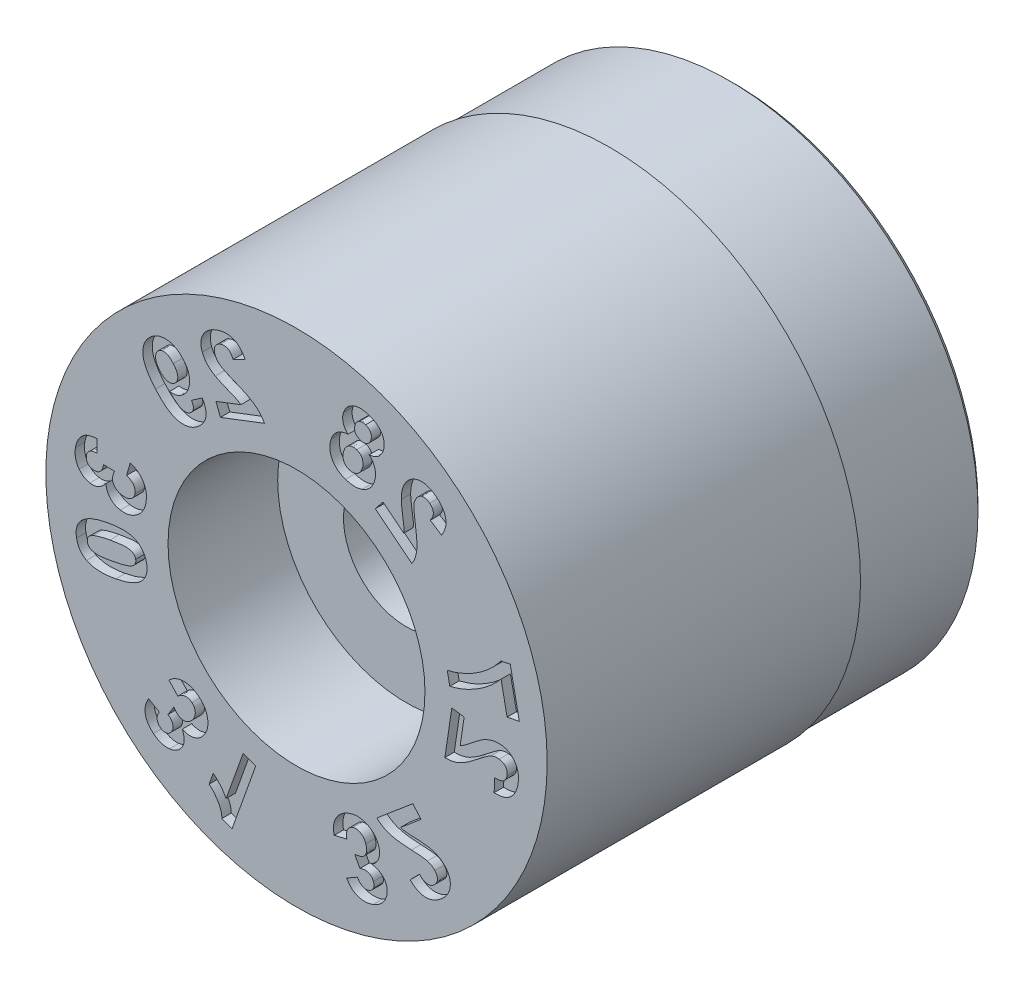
from build123d import *

# Parameters (mm, degrees)
SKETCH4_W          = 4
SKETCH4_H          = 1
CUT_EXTRUDE1_DEPTH = 0.3


with BuildPart() as part:
    # Sketch1 → Revolve1 (revolve)
    with BuildSketch(Plane(origin=(0, 0, 0), x_dir=(0, 0, -1), z_dir=(1, 0, 0)), mode=Mode.PRIVATE) as revolve1_sk:
        Polygon((0, 8), (0, 4.1), (3.5, 4.1), (3.5, 2), (14, 2), (14, 7.75), (13.75, 8), align=None)
    revolve(revolve1_sk.sketch.rotate(Axis((0, 0, 3.797909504), (0, 0, -1)), 90), axis=Axis((0, 0, 3.797909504), (0, 0, -1)))

    # Sketch4 → Cut-Revolve1 (revolve, cut)
    with BuildSketch(Plane(origin=(0, 0, 0), x_dir=(0, 0, -1), z_dir=(1, 0, 0)), mode=Mode.PRIVATE) as cut_revolve1_sk:
        with Locations((12, 8.435)):
            Rectangle(SKETCH4_W, SKETCH4_H)
    revolve(cut_revolve1_sk.sketch.rotate(Axis((0, 0, 0), (0, 0, -1)), 90), axis=Axis((0, 0, 0), (0, 0, -1)), mode=Mode.SUBTRACT)

    # Sketch6 → Cut-Extrude1 (cut)
    # profile 1 of 12: a face of its own
    with BuildSketch(Plane.XY):
        with BuildLine():
            Line((5.350875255, -0.073440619), (4.957338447, -0.014778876))
            Line((4.957338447, -0.014778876), (4.73514166, -1.498937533))
            add(Edge.make_bspline(
                [(4.73514166, -1.498937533), (4.772862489, -1.499467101), (4.848212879, -1.500524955), (4.960666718, -1.485157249), (5.071866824, -1.458538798), (5.163908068, -1.425753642), (5.239549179, -1.39124254), (5.301678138, -1.358306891), (5.369002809, -1.318716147), (5.441513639, -1.272567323), (5.519028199, -1.219199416), (5.601750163, -1.159157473), (5.690104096, -1.092947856), (5.749818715, -1.045458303), (5.780743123, -1.020864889)],
                knots=[0, 0, 0, 0, 1.151830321, 2.3008737, 3.457966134, 4.642906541, 5.280622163, 5.998342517, 6.791414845, 7.667669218, 8.625223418, 9.66778955, 10.79221822, 12, 12, 12, 12], degree=3))
            add(Edge.make_bspline(
                [(5.780743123, -1.020864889), (5.805344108, -1.001313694), (5.852300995, -0.963995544), (5.920174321, -0.911860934), (5.981414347, -0.865335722), (6.036546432, -0.825255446), (6.085164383, -0.791090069), (6.127043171, -0.762649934), (6.162974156, -0.7409212), (6.18511579, -0.729110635), (6.194959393, -0.72385996)],
                knots=[0, 0, 0, 0, 1.477890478, 2.820908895, 4.025130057, 5.094934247, 6.026396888, 6.819876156, 7.47534715, 8, 8, 8, 8], degree=3))
            add(Edge.make_bspline(
                [(6.194959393, -0.72385996), (6.218339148, -0.713728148), (6.263650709, -0.694092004), (6.33349756, -0.677106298), (6.401398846, -0.668848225), (6.445458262, -0.67308828), (6.467208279, -0.675181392)],
                knots=[0, 0, 0, 0, 1.088849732, 2.110265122, 3.067128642, 4, 4, 4, 4], degree=3))
            add(Edge.make_bspline(
                [(6.467208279, -0.675181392), (6.489516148, -0.679210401), (6.531782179, -0.686844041), (6.589048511, -0.710861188), (6.637316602, -0.742118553), (6.675036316, -0.782804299), (6.702412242, -0.830295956), (6.719114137, -0.884041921), (6.725476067, -0.943446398), (6.720707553, -0.984259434), (6.718218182, -1.00556561)],
                knots=[0, 0, 0, 0, 1.15195081, 2.182565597, 3.14163902, 4.060774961, 4.981567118, 5.911636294, 6.9097835, 8, 8, 8, 8], degree=3))
            add(Edge.make_bspline(
                [(6.718218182, -1.00556561), (6.714262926, -1.026486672), (6.706645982, -1.066775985), (6.682548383, -1.121688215), (6.649626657, -1.168403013), (6.614559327, -1.200001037), (6.581976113, -1.220025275), (6.554576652, -1.233203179), (6.52399607, -1.243497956), (6.490364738, -1.251164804), (6.453910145, -1.255749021), (6.414606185, -1.258630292), (6.372257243, -1.25815359), (6.343044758, -1.256215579), (6.327918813, -1.255212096)],
                knots=[0, 0, 0, 0, 1.461692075, 2.814893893, 4.090192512, 5.370595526, 6.030130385, 6.718074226, 7.458567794, 8.246087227, 9.088198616, 9.985036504, 10.956671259, 12, 12, 12, 12], degree=3))
            Line((6.327918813, -1.255212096), (6.307188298, -1.683450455))
            add(Edge.make_bspline(
                [(6.307188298, -1.683450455), (6.335860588, -1.684226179), (6.391548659, -1.685732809), (6.472520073, -1.679857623), (6.548307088, -1.669587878), (6.618510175, -1.652304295), (6.683217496, -1.628805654), (6.743021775, -1.600056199), (6.796967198, -1.564414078), (6.845293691, -1.522903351), (6.888364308, -1.4764953), (6.927888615, -1.426738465), (6.962746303, -1.373001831), (6.992991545, -1.315343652), (7.019462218, -1.253945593), (7.040998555, -1.188518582), (7.059133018, -1.119519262), (7.06707704, -1.071887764), (7.071134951, -1.047556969)],
                knots=[0, 0, 0, 0, 1.236958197, 2.402452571, 3.498689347, 4.53379571, 5.515319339, 6.464782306, 7.390305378, 8.296740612, 9.207131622, 10.1184916, 11.035712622, 11.966420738, 12.925046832, 13.91728129, 14.936119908, 16, 16, 16, 16], degree=3))
            add(Edge.make_bspline(
                [(7.071134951, -1.047556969), (7.074521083, -1.020858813), (7.08111326, -0.968882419), (7.084257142, -0.892229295), (7.081138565, -0.819177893), (7.071806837, -0.749505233), (7.056190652, -0.683330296), (7.034746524, -0.620621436), (7.006638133, -0.561701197), (6.972684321, -0.506834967), (6.934047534, -0.456217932), (6.891033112, -0.411190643), (6.845319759, -0.370665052), (6.795165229, -0.336605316), (6.741903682, -0.307436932), (6.684793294, -0.283937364), (6.624326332, -0.265678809), (6.582286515, -0.258379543), (6.560986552, -0.254681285)],
                knots=[0, 0, 0, 0, 1.218920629, 2.37301404, 3.471042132, 4.527914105, 5.552959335, 6.546883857, 7.5249478, 8.504053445, 9.465489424, 10.404370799, 11.321532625, 12.227895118, 13.145031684, 14.068236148, 15.021249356, 16, 16, 16, 16], degree=3))
            add(Edge.make_bspline(
                [(6.560986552, -0.254681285), (6.536343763, -0.251707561), (6.487286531, -0.245787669), (6.413394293, -0.244938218), (6.340400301, -0.251785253), (6.26751645, -0.264504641), (6.19412598, -0.285933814), (6.118278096, -0.313804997), (6.039969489, -0.349916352), (5.987899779, -0.378375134), (5.961047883, -0.393051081)],
                knots=[0, 0, 0, 0, 0.947880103, 1.886976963, 2.816481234, 3.745825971, 4.709119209, 5.733193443, 6.831027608, 8, 8, 8, 8], degree=3))
            add(Edge.make_bspline(
                [(5.961047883, -0.393051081), (5.951402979, -0.3986831), (5.93070964, -0.410766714), (5.89852655, -0.431716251), (5.862900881, -0.455960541), (5.824300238, -0.484129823), (5.781665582, -0.514474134), (5.736898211, -0.549852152), (5.687813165, -0.587285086), (5.637603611, -0.628134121), (5.587766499, -0.668161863), (5.541361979, -0.705681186), (5.499340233, -0.73888835), (5.461490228, -0.767683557), (5.429022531, -0.793465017), (5.400229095, -0.81401518), (5.376807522, -0.831754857), (5.34038271, -0.855358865), (5.291713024, -0.885370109), (5.246529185, -0.905099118), (5.225054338, -0.914475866)],
                knots=[0, 0, 0, 0, 0.666935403, 1.430923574, 2.29271232, 3.240244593, 4.284655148, 5.417406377, 6.647174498, 7.971140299, 9.282642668, 10.464744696, 11.535005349, 12.481049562, 13.305063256, 14.010310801, 14.593528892, 15.058807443, 16.602118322, 18, 18, 18, 18], degree=3))
            Line((5.225054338, -0.914475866), (5.350875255, -0.073440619))
        make_face()
    # profile 2 of 12: a face of its own
    with BuildSketch(Plane.XY):
        with BuildLine():
            Line((6.721070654, 0.611980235), (7.111057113, 0.69029751))
            Line((7.111057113, 0.69029751), (6.821878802, 2.125430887))
            Line((6.821878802, 2.125430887), (6.517061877, 2.064324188))
            add(Edge.make_bspline(
                [(6.517061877, 2.064324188), (6.50486657, 2.046304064), (6.479728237, 2.009158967), (6.437788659, 1.954193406), (6.391357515, 1.897904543), (6.340025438, 1.840676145), (6.28369971, 1.782577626), (6.223235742, 1.722739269), (6.157702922, 1.662074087), (6.064061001, 1.579817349), (5.941100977, 1.479766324), (5.784858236, 1.369576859), (5.621066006, 1.269607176), (5.479628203, 1.194620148), (5.364659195, 1.14078399), (5.280399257, 1.10311356), (5.197660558, 1.069573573), (5.117169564, 1.038702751), (5.038138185, 1.012675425), (4.961139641, 0.989390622), (4.885836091, 0.96988574), (4.835937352, 0.959264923), (4.811435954, 0.954049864)],
                knots=[0, 0, 0, 0, 0.627947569, 1.29439583, 1.994638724, 2.733700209, 3.512664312, 4.330021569, 5.188834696, 6.089805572, 7.927466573, 9.761424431, 11.603802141, 13.46282929, 14.378674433, 15.267837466, 16.1265192, 16.955357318, 17.75558983, 18.527569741, 19.277003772, 20, 20, 20, 20], degree=3))
            Line((4.811435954, 0.954049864), (4.892847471, 0.549718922))
            add(Edge.make_bspline(
                [(4.892847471, 0.549718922), (4.930528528, 0.558813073), (5.006117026, 0.57705601), (5.11824904, 0.610799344), (5.230058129, 0.649403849), (5.341472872, 0.69325422), (5.452331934, 0.742736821), (5.562240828, 0.798145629), (5.672302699, 0.857736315), (5.78090826, 0.923168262), (5.887796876, 0.992207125), (5.991025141, 1.065039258), (6.090645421, 1.140548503), (6.186215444, 1.219361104), (6.277777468, 1.301366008), (6.365605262, 1.386262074), (6.4496601, 1.474173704), (6.502470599, 1.535541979), (6.528859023, 1.566206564)],
                knots=[0, 0, 0, 0, 0.950054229, 1.905816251, 2.869084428, 3.848979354, 4.839920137, 5.843854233, 6.865546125, 7.907221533, 8.95111465, 9.984134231, 11.003333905, 12.014684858, 13.019813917, 14.015608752, 15.008436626, 16, 16, 16, 16], degree=3))
            Line((6.528859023, 1.566206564), (6.721070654, 0.611980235))
        make_face()
    # profile 3 of 12: a face of its own
    with BuildSketch(Plane.XY):
        with BuildLine():
            Line((2.762568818, 4.578337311), (2.514831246, 4.269103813))
            Line((2.514831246, 4.269103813), (3.681748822, 3.333739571))
            add(Edge.make_bspline(
                [(3.681748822, 3.333739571), (3.700982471, 3.366039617), (3.739411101, 3.430574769), (3.783102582, 3.534858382), (3.815627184, 3.643924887), (3.83344944, 3.739535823), (3.841320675, 3.821891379), (3.844094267, 3.89189341), (3.843851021, 3.96963377), (3.840585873, 4.05526911), (3.833416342, 4.148739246), (3.82341279, 4.25011136), (3.810282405, 4.359258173), (3.799567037, 4.434526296), (3.79402236, 4.47347385)],
                knots=[0, 0, 0, 0, 1.152634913, 2.30295245, 3.45890298, 4.640782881, 5.280928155, 5.996762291, 6.78999092, 7.666401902, 8.626306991, 9.666668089, 10.792615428, 12, 12, 12, 12], degree=3))
            add(Edge.make_bspline(
                [(3.79402236, 4.47347385), (3.789493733, 4.504488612), (3.780845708, 4.563715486), (3.77035678, 4.648424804), (3.760238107, 4.724478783), (3.754066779, 4.79210241), (3.748345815, 4.85097742), (3.74571351, 4.901291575), (3.744298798, 4.942981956), (3.745331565, 4.967909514), (3.745787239, 4.978907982)],
                knots=[0, 0, 0, 0, 1.479812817, 2.82590221, 4.030069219, 5.10173218, 6.031742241, 6.822408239, 7.480426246, 8, 8, 8, 8], degree=3))
            add(Edge.make_bspline(
                [(3.745787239, 4.978907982), (3.748698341, 5.004183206), (3.754338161, 5.053150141), (3.774930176, 5.121891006), (3.801858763, 5.184681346), (3.827869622, 5.220466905), (3.840715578, 5.238140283)],
                knots=[0, 0, 0, 0, 1.088572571, 2.108945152, 3.066066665, 4, 4, 4, 4], degree=3))
            add(Edge.make_bspline(
                [(3.840715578, 5.238140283), (3.855416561, 5.255191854), (3.883227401, 5.287449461), (3.932238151, 5.324818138), (3.983382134, 5.350354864), (4.037084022, 5.362697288), (4.091735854, 5.362529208), (4.146092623, 5.34974649), (4.200302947, 5.325373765), (4.23300936, 5.301002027), (4.250184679, 5.288203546)],
                knots=[0, 0, 0, 0, 1.15160422, 2.178567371, 3.136950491, 4.061269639, 4.976915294, 5.914078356, 6.904607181, 8, 8, 8, 8], degree=3))
            add(Edge.make_bspline(
                [(4.250184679, 5.288203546), (4.266327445, 5.274229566), (4.297156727, 5.247542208), (4.332405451, 5.199257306), (4.356312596, 5.14774261), (4.366326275, 5.101626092), (4.367390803, 5.063511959), (4.364635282, 5.03330436), (4.358081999, 5.002068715), (4.347998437, 4.969301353), (4.333589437, 4.935534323), (4.316152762, 4.90009602), (4.294215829, 4.863930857), (4.278038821, 4.839723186), (4.269656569, 4.827179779)],
                knots=[0, 0, 0, 0, 1.470349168, 2.80805718, 4.091948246, 5.367977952, 6.03328278, 6.718979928, 7.457349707, 8.23324399, 9.082256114, 9.989540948, 10.958263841, 12, 12, 12, 12], degree=3))
            Line((4.269656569, 4.827179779), (4.628081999, 4.594953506))
            add(Edge.make_bspline(
                [(4.628081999, 4.594953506), (4.642947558, 4.619384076), (4.671744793, 4.666710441), (4.708534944, 4.738560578), (4.736354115, 4.80926851), (4.757083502, 4.878075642), (4.769857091, 4.94552387), (4.774088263, 5.011307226), (4.771609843, 5.075597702), (4.759648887, 5.137842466), (4.741291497, 5.198298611), (4.718420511, 5.257297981), (4.68912878, 5.314139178), (4.655419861, 5.36953902), (4.615393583, 5.422877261), (4.570460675, 5.474704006), (4.51930895, 5.524145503), (4.482456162, 5.555103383), (4.463633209, 5.570915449)],
                knots=[0, 0, 0, 0, 1.239077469, 2.400313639, 3.49278845, 4.527332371, 5.510448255, 6.460209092, 7.378567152, 8.290626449, 9.197932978, 10.11416542, 11.028452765, 11.965272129, 12.921149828, 13.914623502, 14.934871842, 16, 16, 16, 16], degree=3))
            add(Edge.make_bspline(
                [(4.463633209, 5.570915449), (4.442501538, 5.587328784), (4.401305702, 5.619326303), (4.336484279, 5.659845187), (4.272068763, 5.69411678), (4.207325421, 5.7209263), (4.142740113, 5.741185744), (4.077983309, 5.75377365), (4.01316044, 5.75962377), (3.948798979, 5.757402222), (3.885935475, 5.749593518), (3.825327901, 5.73596578), (3.767857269, 5.715564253), (3.713056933, 5.690191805), (3.661415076, 5.658636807), (3.612699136, 5.621267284), (3.566453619, 5.578374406), (3.539031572, 5.545789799), (3.525108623, 5.529245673)],
                knots=[0, 0, 0, 0, 1.215646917, 2.369883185, 3.469989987, 4.529159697, 5.550802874, 6.541783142, 7.522472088, 8.502970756, 9.463256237, 10.398963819, 11.320657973, 12.230355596, 13.139642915, 14.065528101, 15.01781391, 16, 16, 16, 16], degree=3))
            add(Edge.make_bspline(
                [(3.525108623, 5.529245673), (3.510049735, 5.509512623), (3.480214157, 5.470416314), (3.44285283, 5.406977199), (3.411620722, 5.340950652), (3.386816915, 5.271425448), (3.368611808, 5.197516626), (3.354379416, 5.118380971), (3.346467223, 5.032906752), (3.344648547, 4.973862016), (3.343710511, 4.943407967)],
                knots=[0, 0, 0, 0, 0.951445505, 1.885061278, 2.817609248, 3.749801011, 4.711126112, 5.73427302, 6.831385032, 8, 8, 8, 8], degree=3))
            add(Edge.make_bspline(
                [(3.343710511, 4.943407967), (3.343825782, 4.932211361), (3.344073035, 4.908195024), (3.345700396, 4.869927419), (3.34873605, 4.827184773), (3.353345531, 4.779994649), (3.358697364, 4.728118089), (3.365794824, 4.671655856), (3.374162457, 4.610724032), (3.384003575, 4.547157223), (3.393324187, 4.484293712), (3.402310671, 4.425632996), (3.409820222, 4.372823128), (3.416189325, 4.325900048), (3.420957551, 4.284822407), (3.425194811, 4.249720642), (3.42812512, 4.220483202), (3.430711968, 4.177301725), (3.431652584, 4.120412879), (3.426291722, 4.071672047), (3.423739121, 4.04846385)],
                knots=[0, 0, 0, 0, 0.671311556, 1.43994044, 2.296018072, 3.240125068, 4.282625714, 5.422750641, 6.65181899, 7.970046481, 9.279287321, 10.46209737, 11.528110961, 12.477403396, 13.301117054, 14.007415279, 14.597343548, 15.062361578, 16.601228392, 18, 18, 18, 18], degree=3))
            Line((3.423739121, 4.04846385), (2.762568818, 4.578337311))
        make_face()
    # profile 4 of 12: a face of its own
    with BuildSketch(Plane.XY):
        with BuildLine():
            add(Edge.make_bspline(
                [(2.317323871, 5.660368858), (2.346004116, 5.663309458), (2.401085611, 5.668956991), (2.478868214, 5.690393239), (2.548149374, 5.721289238), (2.60858263, 5.762228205), (2.659878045, 5.811361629), (2.703401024, 5.866396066), (2.739889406, 5.926824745), (2.756793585, 5.970881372), (2.765332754, 5.993136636)],
                knots=[0, 0, 0, 0, 1.162365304, 2.232366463, 3.241782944, 4.212380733, 5.163777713, 6.097983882, 7.039193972, 8, 8, 8, 8], degree=3))
            add(Edge.make_bspline(
                [(2.765332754, 5.993136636), (2.771512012, 6.012505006), (2.783639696, 6.050518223), (2.794250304, 6.108603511), (2.799812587, 6.165829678), (2.798937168, 6.222181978), (2.79231831, 6.277805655), (2.778929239, 6.332386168), (2.760145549, 6.386415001), (2.735421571, 6.439241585), (2.70435329, 6.489981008), (2.667503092, 6.538091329), (2.623897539, 6.58214733), (2.575217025, 6.623576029), (2.519626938, 6.660631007), (2.458795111, 6.695441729), (2.391463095, 6.725933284), (2.344101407, 6.743276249), (2.319774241, 6.752184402)],
                knots=[0, 0, 0, 0, 0.98236942, 1.928041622, 2.849277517, 3.759413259, 4.648329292, 5.552790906, 6.471846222, 7.411047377, 8.367848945, 9.344261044, 10.334899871, 11.360396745, 12.430565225, 13.560959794, 14.747195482, 16, 16, 16, 16], degree=3))
            add(Edge.make_bspline(
                [(2.319774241, 6.752184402), (2.295352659, 6.76013426), (2.247783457, 6.775619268), (2.176350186, 6.79189917), (2.107339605, 6.801744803), (2.040962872, 6.80606627), (1.977074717, 6.803875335), (1.915766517, 6.794953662), (1.856783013, 6.780321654), (1.801096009, 6.758569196), (1.748340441, 6.732873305), (1.699893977, 6.701841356), (1.655936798, 6.666449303), (1.616185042, 6.626921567), (1.580534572, 6.583212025), (1.549771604, 6.534702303), (1.52257572, 6.48228702), (1.508798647, 6.444787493), (1.501775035, 6.425670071)],
                knots=[0, 0, 0, 0, 1.242294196, 2.419783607, 3.539737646, 4.612471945, 5.634517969, 6.626783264, 7.605533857, 8.568085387, 9.514244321, 10.440959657, 11.345538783, 12.240070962, 13.149079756, 14.068580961, 15.015354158, 16, 16, 16, 16], degree=3))
            add(Edge.make_bspline(
                [(1.501775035, 6.425670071), (1.494535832, 6.401648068), (1.480291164, 6.354379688), (1.471205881, 6.281459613), (1.473649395, 6.209225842), (1.48717909, 6.138595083), (1.509945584, 6.069967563), (1.544901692, 6.00601097), (1.587760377, 5.944658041), (1.623987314, 5.909408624), (1.642529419, 5.891366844)],
                knots=[0, 0, 0, 0, 1.025235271, 2.017367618, 2.991043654, 3.970756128, 4.951162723, 5.936165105, 6.943663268, 8, 8, 8, 8], degree=3))
            add(Edge.make_bspline(
                [(1.642529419, 5.891366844), (1.626287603, 5.890274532), (1.594241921, 5.88811936), (1.547304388, 5.880863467), (1.502056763, 5.871563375), (1.459031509, 5.858380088), (1.417679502, 5.843071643), (1.378659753, 5.824014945), (1.341292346, 5.802510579), (1.29438205, 5.77015459), (1.241188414, 5.722581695), (1.186063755, 5.656727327), (1.140797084, 5.581117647), (1.119456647, 5.525785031), (1.108531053, 5.497456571)],
                knots=[0, 0, 0, 0, 0.827120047, 1.631937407, 2.412285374, 3.173142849, 3.917139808, 4.651470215, 5.377613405, 6.10704251, 7.545000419, 8.989433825, 10.458690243, 12, 12, 12, 12], degree=3))
            add(Edge.make_bspline(
                [(1.108531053, 5.497456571), (1.100855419, 5.473527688), (1.085806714, 5.426613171), (1.071728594, 5.355350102), (1.06385221, 5.285798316), (1.063674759, 5.217474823), (1.069739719, 5.150533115), (1.083441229, 5.084959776), (1.10394257, 5.021052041), (1.131094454, 4.958989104), (1.164963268, 4.900119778), (1.204489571, 4.844686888), (1.249743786, 4.793572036), (1.301680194, 4.747535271), (1.358788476, 4.70568733), (1.42182155, 4.668121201), (1.490475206, 4.634697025), (1.539416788, 4.617008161), (1.564373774, 4.607988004)],
                knots=[0, 0, 0, 0, 1.071042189, 2.099865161, 3.092282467, 4.052247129, 5.008848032, 5.954113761, 6.903281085, 7.866789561, 8.837854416, 9.794734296, 10.766243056, 11.742810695, 12.749197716, 13.781686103, 14.868805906, 16, 16, 16, 16], degree=3))
            add(Edge.make_bspline(
                [(1.564373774, 4.607988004), (1.587898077, 4.600332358), (1.634126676, 4.585287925), (1.704136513, 4.569983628), (1.77245311, 4.558800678), (1.8396292, 4.554853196), (1.90549058, 4.555419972), (1.969825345, 4.562991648), (2.032897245, 4.57558243), (2.073514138, 4.588630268), (2.093931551, 4.595189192)],
                knots=[0, 0, 0, 0, 1.098882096, 2.159459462, 3.181649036, 4.172516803, 5.146568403, 6.105207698, 7.04752055, 8, 8, 8, 8], degree=3))
            add(Edge.make_bspline(
                [(2.093931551, 4.595189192), (2.117073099, 4.604092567), (2.162666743, 4.621634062), (2.225955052, 4.657410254), (2.284149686, 4.6988652), (2.336485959, 4.747427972), (2.383022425, 4.802507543), (2.423614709, 4.864356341), (2.458751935, 4.932527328), (2.476978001, 4.981373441), (2.486276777, 5.006294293)],
                knots=[0, 0, 0, 0, 1.008307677, 1.986575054, 2.950354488, 3.911704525, 4.885217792, 5.878854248, 6.917810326, 8, 8, 8, 8], degree=3))
            add(Edge.make_bspline(
                [(2.486276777, 5.006294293), (2.49490391, 5.0346288), (2.511935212, 5.090565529), (2.522978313, 5.177126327), (2.523164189, 5.263412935), (2.513263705, 5.334957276), (2.498982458, 5.391362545), (2.484241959, 5.433012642), (2.465846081, 5.47356312), (2.443452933, 5.513026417), (2.417847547, 5.551883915), (2.387532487, 5.589075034), (2.354434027, 5.62590344), (2.329839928, 5.648744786), (2.317323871, 5.660368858)],
                knots=[0, 0, 0, 0, 1.479919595, 2.921591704, 4.347178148, 5.787928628, 6.521819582, 7.255864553, 7.995738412, 8.74698395, 9.524407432, 10.321254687, 11.145678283, 12, 12, 12, 12], degree=3))
        make_face()
        with BuildLine():
            add(Edge.make_bspline(
                [(2.373464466, 6.094908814), (2.366373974, 6.076100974), (2.352781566, 6.04004652), (2.321675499, 5.993502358), (2.28502059, 5.955776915), (2.241946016, 5.92846777), (2.194201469, 5.91171855), (2.143395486, 5.90538137), (2.089731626, 5.909349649), (2.054622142, 5.919909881), (2.036272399, 5.925429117)],
                knots=[0, 0, 0, 0, 1.12684109, 2.160143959, 3.121923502, 4.065126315, 4.999971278, 5.943665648, 6.925270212, 8, 8, 8, 8], degree=3))
            add(Edge.make_bspline(
                [(2.036272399, 5.925429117), (2.01824643, 5.9323206), (1.983572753, 5.945576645), (1.93860221, 5.976184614), (1.901448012, 6.012302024), (1.874051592, 6.055566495), (1.857085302, 6.104092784), (1.849735, 6.156656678), (1.855360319, 6.212691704), (1.866126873, 6.249699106), (1.871753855, 6.269040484)],
                knots=[0, 0, 0, 0, 1.072446, 2.062893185, 3.008124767, 3.943249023, 4.888703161, 5.853940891, 6.878393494, 8, 8, 8, 8], degree=3))
            add(Edge.make_bspline(
                [(1.871753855, 6.269040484), (1.87873334, 6.286815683), (1.89211067, 6.320884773), (1.92189735, 6.365751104), (1.958783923, 6.401426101), (2.001482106, 6.428402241), (2.048661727, 6.445826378), (2.099173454, 6.45271108), (2.152347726, 6.449637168), (2.18707175, 6.439030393), (2.205087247, 6.433527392)],
                knots=[0, 0, 0, 0, 1.093228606, 2.095352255, 3.061895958, 4.016181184, 4.9726822, 5.923458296, 6.922649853, 8, 8, 8, 8], degree=3))
            add(Edge.make_bspline(
                [(2.205087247, 6.433527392), (2.223312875, 6.426392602), (2.258409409, 6.412653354), (2.304511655, 6.382341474), (2.341731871, 6.34520569), (2.36884669, 6.301564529), (2.386547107, 6.253584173), (2.393106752, 6.20233872), (2.389685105, 6.148439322), (2.379023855, 6.113255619), (2.373464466, 6.094908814)],
                knots=[0, 0, 0, 0, 1.099285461, 2.116860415, 3.080775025, 4.035858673, 4.985988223, 5.936719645, 6.924087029, 8, 8, 8, 8], degree=3))
        make_face(mode=Mode.SUBTRACT)
        with BuildLine():
            add(Edge.make_bspline(
                [(2.101774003, 5.180984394), (2.096949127, 5.167512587), (2.087551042, 5.141271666), (2.070355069, 5.104243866), (2.051158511, 5.070664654), (2.030563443, 5.039911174), (2.007717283, 5.012499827), (1.982805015, 4.988460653), (1.956206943, 4.967320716), (1.918833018, 4.944173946), (1.869606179, 4.922930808), (1.807720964, 4.911068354), (1.744220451, 4.912368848), (1.703385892, 4.924217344), (1.682449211, 4.9302923)],
                knots=[0, 0, 0, 0, 0.937662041, 1.82641552, 2.671824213, 3.471057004, 4.249635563, 5.005907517, 5.736809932, 6.47221025, 7.883135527, 9.222797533, 10.576073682, 12, 12, 12, 12], degree=3))
            add(Edge.make_bspline(
                [(1.682449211, 4.9302923), (1.662671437, 4.938083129), (1.624222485, 4.953228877), (1.574928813, 4.990372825), (1.534476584, 5.035849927), (1.509708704, 5.081231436), (1.494760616, 5.120752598), (1.487225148, 5.15281475), (1.482882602, 5.186404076), (1.482360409, 5.221741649), (1.485292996, 5.258572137), (1.490744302, 5.297055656), (1.50079531, 5.336890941), (1.509290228, 5.363683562), (1.513658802, 5.377461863)],
                knots=[0, 0, 0, 0, 1.415192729, 2.751203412, 4.080668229, 5.457352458, 6.179096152, 6.900560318, 7.653289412, 8.439057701, 9.25794852, 10.121206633, 11.033816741, 12, 12, 12, 12], degree=3))
            add(Edge.make_bspline(
                [(1.513658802, 5.377461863), (1.51810742, 5.389350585), (1.526822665, 5.412641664), (1.541996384, 5.445932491), (1.559815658, 5.476257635), (1.57936488, 5.503841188), (1.600807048, 5.528933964), (1.624708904, 5.550619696), (1.650129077, 5.570449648), (1.686532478, 5.592121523), (1.734594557, 5.612524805), (1.795543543, 5.623972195), (1.858411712, 5.622220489), (1.898930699, 5.610348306), (1.919656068, 5.604275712)],
                knots=[0, 0, 0, 0, 0.875606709, 1.715392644, 2.520166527, 3.2981308, 4.045530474, 4.791851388, 5.520916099, 6.265796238, 7.709488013, 9.096985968, 10.515115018, 12, 12, 12, 12], degree=3))
            add(Edge.make_bspline(
                [(1.919656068, 5.604275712), (1.931616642, 5.599979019), (1.95479673, 5.591651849), (1.986545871, 5.574695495), (2.015280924, 5.556351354), (2.040418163, 5.535141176), (2.06221376, 5.511690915), (2.079998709, 5.485444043), (2.095290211, 5.457396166), (2.1091633, 5.416701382), (2.120212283, 5.364722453), (2.124477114, 5.302147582), (2.119265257, 5.240242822), (2.107616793, 5.200779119), (2.101774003, 5.180984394)],
                knots=[0, 0, 0, 0, 0.883574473, 1.712403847, 2.499326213, 3.253019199, 3.995820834, 4.720207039, 5.455087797, 6.212328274, 7.70414049, 9.141618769, 10.566255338, 12, 12, 12, 12], degree=3))
        make_face(mode=Mode.SUBTRACT)
    # profile 5 of 12: a face of its own
    with BuildSketch(Plane.XY):
        with BuildLine():
            Line((-2.570328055, 4.692949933), (-2.427641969, 4.321654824))
            Line((-2.427641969, 4.321654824), (-1.026508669, 4.859778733))
            add(Edge.make_bspline(
                [(-1.026508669, 4.859778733), (-1.044678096, 4.892742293), (-1.080930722, 4.958512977), (-1.149285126, 5.048798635), (-1.226937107, 5.132526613), (-1.300811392, 5.196558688), (-1.368246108, 5.245281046), (-1.427540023, 5.283465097), (-1.495612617, 5.322001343), (-1.571525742, 5.362673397), (-1.656166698, 5.403639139), (-1.748890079, 5.446739), (-1.850216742, 5.49046917), (-1.920965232, 5.519187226), (-1.957576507, 5.534048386)],
                knots=[0, 0, 0, 0, 1.149499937, 2.293544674, 3.45122022, 4.636274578, 5.275017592, 5.993729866, 6.791192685, 7.665937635, 8.626380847, 9.665590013, 10.791978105, 12, 12, 12, 12], degree=3))
            add(Edge.make_bspline(
                [(-1.957576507, 5.534048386), (-1.986728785, 5.546021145), (-2.042236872, 5.568818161), (-2.121574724, 5.60102582), (-2.19211364, 5.631691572), (-2.254260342, 5.659524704), (-2.307813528, 5.68526027), (-2.353145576, 5.707680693), (-2.389973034, 5.727915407), (-2.411018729, 5.741513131), (-2.420329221, 5.747528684)],
                knots=[0, 0, 0, 0, 1.482350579, 2.822504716, 4.027283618, 5.099975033, 6.02516901, 6.821730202, 7.478740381, 8, 8, 8, 8], degree=3))
            add(Edge.make_bspline(
                [(-2.420329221, 5.747528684), (-2.440683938, 5.763052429), (-2.480068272, 5.793089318), (-2.529941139, 5.845183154), (-2.569933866, 5.900729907), (-2.587941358, 5.941127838), (-2.596808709, 5.961020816)],
                knots=[0, 0, 0, 0, 1.092552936, 2.113980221, 3.071275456, 4, 4, 4, 4], degree=3))
            add(Edge.make_bspline(
                [(-2.596808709, 5.961020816), (-2.60411771, 5.982440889), (-2.617995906, 6.023112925), (-2.625803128, 6.084704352), (-2.622663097, 6.142294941), (-2.605619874, 6.195067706), (-2.577808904, 6.24219701), (-2.53961935, 6.283403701), (-2.49036972, 6.317257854), (-2.45267045, 6.333570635), (-2.432922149, 6.342115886)],
                knots=[0, 0, 0, 0, 1.15046769, 2.184486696, 3.142601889, 4.06545904, 4.980506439, 5.910478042, 6.905429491, 8, 8, 8, 8], degree=3))
            add(Edge.make_bspline(
                [(-2.432922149, 6.342115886), (-2.412697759, 6.348978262), (-2.373985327, 6.362113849), (-2.314313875, 6.368383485), (-2.257359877, 6.363163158), (-2.212357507, 6.348202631), (-2.17890236, 6.32964541), (-2.153866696, 6.312423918), (-2.130429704, 6.290301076), (-2.106829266, 6.265278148), (-2.085099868, 6.235627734), (-2.063136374, 6.202823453), (-2.042765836, 6.165613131), (-2.029928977, 6.139270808), (-2.023302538, 6.125672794)],
                knots=[0, 0, 0, 0, 1.465567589, 2.805310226, 4.09296568, 5.375008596, 6.032058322, 6.721557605, 7.458973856, 8.244580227, 9.084919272, 9.983916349, 10.959289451, 12, 12, 12, 12], degree=3))
            Line((-2.023302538, 6.125672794), (-1.640128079, 6.318480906))
            add(Edge.make_bspline(
                [(-1.640128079, 6.318480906), (-1.653620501, 6.343807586), (-1.679767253, 6.392887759), (-1.724566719, 6.460541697), (-1.771137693, 6.521036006), (-1.820907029, 6.573520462), (-1.87276569, 6.618843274), (-1.927710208, 6.656012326), (-1.984912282, 6.68602128), (-2.044910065, 6.707492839), (-2.106578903, 6.722226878), (-2.169462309, 6.732183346), (-2.233609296, 6.735688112), (-2.29882149, 6.733552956), (-2.365138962, 6.726045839), (-2.432769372, 6.713314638), (-2.50153186, 6.694445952), (-2.547045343, 6.678070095), (-2.57023591, 6.669726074)],
                knots=[0, 0, 0, 0, 1.237490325, 2.39811299, 3.496363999, 4.527360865, 5.513892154, 6.46191341, 7.382957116, 8.293516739, 9.203268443, 10.115441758, 11.036759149, 11.970489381, 12.927487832, 13.913571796, 14.936898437, 16, 16, 16, 16], degree=3))
            add(Edge.make_bspline(
                [(-2.57023591, 6.669726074), (-2.595106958, 6.659594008), (-2.643577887, 6.639847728), (-2.711654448, 6.604556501), (-2.773817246, 6.56595362), (-2.829851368, 6.523538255), (-2.879768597, 6.477451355), (-2.923714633, 6.4278949), (-2.960637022, 6.374048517), (-2.992083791, 6.317638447), (-3.016568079, 6.258972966), (-3.035476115, 6.199651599), (-3.046785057, 6.139628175), (-3.053641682, 6.079343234), (-3.051215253, 6.018602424), (-3.044134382, 5.957453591), (-3.030074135, 5.895834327), (-3.015908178, 5.85558556), (-3.008712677, 5.83514147)],
                knots=[0, 0, 0, 0, 1.216574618, 2.370969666, 3.470234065, 4.52931009, 5.550727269, 6.544771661, 7.524133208, 8.50387338, 9.4664039, 10.400581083, 11.319774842, 12.23076135, 13.143578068, 14.067299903, 15.018298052, 16, 16, 16, 16], degree=3))
            add(Edge.make_bspline(
                [(-3.008712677, 5.83514147), (-2.999149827, 5.812192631), (-2.980204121, 5.766726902), (-2.944548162, 5.702124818), (-2.902892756, 5.641897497), (-2.855478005, 5.585104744), (-2.801186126, 5.531328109), (-2.739488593, 5.479209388), (-2.669598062, 5.428672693), (-2.619057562, 5.397597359), (-2.592997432, 5.381574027)],
                knots=[0, 0, 0, 0, 0.949956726, 1.882033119, 2.81462261, 3.745760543, 4.706371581, 5.732332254, 6.83072557, 8, 8, 8, 8], degree=3))
            add(Edge.make_bspline(
                [(-2.592997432, 5.381574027), (-2.583349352, 5.375854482), (-2.562656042, 5.363587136), (-2.528324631, 5.34630721), (-2.489942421, 5.326868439), (-2.446580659, 5.306709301), (-2.39868381, 5.285630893), (-2.346078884, 5.263324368), (-2.289212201, 5.239574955), (-2.229051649, 5.215740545), (-2.169673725, 5.192316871), (-2.114375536, 5.170090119), (-2.064644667, 5.150201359), (-2.020942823, 5.131381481), (-1.982496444, 5.115623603), (-1.950230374, 5.100960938), (-1.923358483, 5.088974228), (-1.884598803, 5.069604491), (-1.834760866, 5.041553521), (-1.795404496, 5.011846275), (-1.776619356, 4.997666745)],
                knots=[0, 0, 0, 0, 0.669480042, 1.435908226, 2.293786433, 3.238447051, 4.29043014, 5.418165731, 6.64998314, 7.969846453, 9.281668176, 10.461125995, 11.528297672, 12.479367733, 13.302004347, 14.008787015, 14.595369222, 15.058452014, 16.595973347, 18, 18, 18, 18], degree=3))
            Line((-1.776619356, 4.997666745), (-2.570328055, 4.692949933))
        make_face()
    # profile 6 of 12: a face of its own
    with BuildSketch(Plane.XY):
        with BuildLine():
            Line((-3.008865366, 4.568578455), (-3.35297919, 4.331031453))
            add(Edge.make_bspline(
                [(-3.35297919, 4.331031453), (-3.342218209, 4.313902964), (-3.321946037, 4.281635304), (-3.300698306, 4.231361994), (-3.289052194, 4.183286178), (-3.288007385, 4.136954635), (-3.297276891, 4.093101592), (-3.315336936, 4.051754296), (-3.342356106, 4.012826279), (-3.365749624, 3.990576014), (-3.377923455, 3.978997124)],
                knots=[0, 0, 0, 0, 1.233612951, 2.323952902, 3.317225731, 4.23725559, 5.128852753, 6.032452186, 6.976101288, 8, 8, 8, 8], degree=3))
            add(Edge.make_bspline(
                [(-3.377923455, 3.978997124), (-3.38645273, 3.972120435), (-3.403230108, 3.958593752), (-3.431096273, 3.942394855), (-3.460218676, 3.929647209), (-3.491017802, 3.920633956), (-3.523452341, 3.91587264), (-3.557383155, 3.914274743), (-3.592904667, 3.916783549), (-3.630496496, 3.922974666), (-3.670969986, 3.934784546), (-3.714546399, 3.95432609), (-3.761735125, 3.981495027), (-3.812569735, 4.016337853), (-3.867137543, 4.058632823), (-3.925699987, 4.108140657), (-3.987909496, 4.165315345), (-4.029749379, 4.206852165), (-4.051566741, 4.228511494)],
                knots=[0, 0, 0, 0, 0.66156566, 1.301322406, 1.941594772, 2.579802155, 3.234913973, 3.918980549, 4.629549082, 5.38365856, 6.218604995, 7.170590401, 8.263576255, 9.50662327, 10.893502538, 12.435905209, 14.141506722, 16, 16, 16, 16], degree=3))
            add(Edge.make_bspline(
                [(-4.051566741, 4.228511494), (-4.031391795, 4.226073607), (-3.991897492, 4.221301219), (-3.933096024, 4.221950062), (-3.876321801, 4.227762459), (-3.821264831, 4.239952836), (-3.768322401, 4.259097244), (-3.717256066, 4.283909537), (-3.667602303, 4.314061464), (-3.637559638, 4.339116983), (-3.622278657, 4.351861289)],
                knots=[0, 0, 0, 0, 1.055468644, 2.066176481, 3.049347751, 4.018362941, 4.989641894, 5.968802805, 6.966846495, 8, 8, 8, 8], degree=3))
            add(Edge.make_bspline(
                [(-3.622278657, 4.351861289), (-3.606294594, 4.366433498), (-3.574679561, 4.395256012), (-3.533546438, 4.444053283), (-3.498171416, 4.496060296), (-3.468725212, 4.551384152), (-3.445202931, 4.60998143), (-3.427749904, 4.671891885), (-3.41626441, 4.737180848), (-3.410498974, 4.804989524), (-3.41165735, 4.87402782), (-3.41880855, 4.942824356), (-3.434134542, 5.010492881), (-3.456150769, 5.077220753), (-3.485134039, 5.14298196), (-3.521220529, 5.207657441), (-3.564779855, 5.270866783), (-3.597938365, 5.311062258), (-3.614853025, 5.331566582)],
                knots=[0, 0, 0, 0, 0.948940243, 1.876918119, 2.794519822, 3.706483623, 4.623326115, 5.561936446, 6.525690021, 7.530218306, 8.545413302, 9.553466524, 10.561886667, 11.585662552, 12.634614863, 13.712623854, 14.833174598, 16, 16, 16, 16], degree=3))
            add(Edge.make_bspline(
                [(-3.614853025, 5.331566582), (-3.633501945, 5.352045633), (-3.670001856, 5.392127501), (-3.729061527, 5.445909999), (-3.790314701, 5.492101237), (-3.853602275, 5.531155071), (-3.919055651, 5.562968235), (-3.986569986, 5.587786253), (-4.056290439, 5.605157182), (-4.127402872, 5.614750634), (-4.198717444, 5.61727777), (-4.268963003, 5.612811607), (-4.337584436, 5.600981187), (-4.404729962, 5.582556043), (-4.469899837, 5.555738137), (-4.533507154, 5.522533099), (-4.595477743, 5.481807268), (-4.634108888, 5.44987414), (-4.653861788, 5.433546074)],
                knots=[0, 0, 0, 0, 1.133491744, 2.21848487, 3.264564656, 4.270076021, 5.258224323, 6.238974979, 7.209644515, 8.193783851, 9.171211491, 10.126619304, 11.070012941, 12.017408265, 12.971072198, 13.949215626, 14.951391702, 16, 16, 16, 16], degree=3))
            add(Edge.make_bspline(
                [(-4.653861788, 5.433546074), (-4.674381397, 5.414705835), (-4.714604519, 5.377774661), (-4.766272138, 5.315684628), (-4.810422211, 5.250448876), (-4.84567122, 5.181117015), (-4.873444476, 5.108191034), (-4.891863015, 5.031315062), (-4.902476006, 4.950876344), (-4.904483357, 4.866798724), (-4.896432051, 4.778845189), (-4.876529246, 4.687176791), (-4.84302163, 4.592470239), (-4.798783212, 4.493930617), (-4.741543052, 4.392459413), (-4.672787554, 4.287162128), (-4.591964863, 4.178281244), (-4.531390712, 4.106696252), (-4.500056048, 4.069665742)],
                knots=[0, 0, 0, 0, 0.861575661, 1.688885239, 2.493982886, 3.2956336, 4.091229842, 4.904402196, 5.737029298, 6.598956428, 7.502618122, 8.465102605, 9.494807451, 10.607109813, 11.805303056, 13.097398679, 14.498500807, 16, 16, 16, 16], degree=3))
            add(Edge.make_bspline(
                [(-4.500056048, 4.069665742), (-4.467127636, 4.032801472), (-4.403565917, 3.961642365), (-4.305213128, 3.864617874), (-4.20906631, 3.779619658), (-4.114021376, 3.707659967), (-4.020305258, 3.648905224), (-3.928470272, 3.602308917), (-3.8381079, 3.568129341), (-3.748838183, 3.547848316), (-3.661985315, 3.538154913), (-3.577405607, 3.537823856), (-3.495135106, 3.547087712), (-3.415105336, 3.565453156), (-3.337195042, 3.592506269), (-3.262434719, 3.630524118), (-3.189248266, 3.676375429), (-3.144002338, 3.713409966), (-3.120957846, 3.732272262)],
                knots=[0, 0, 0, 0, 1.475544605, 2.848243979, 4.122328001, 5.304840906, 6.403434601, 7.420536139, 8.375179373, 9.280054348, 10.146241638, 10.979837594, 11.800208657, 12.612457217, 13.427068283, 14.255785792, 15.111643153, 16, 16, 16, 16], degree=3))
            add(Edge.make_bspline(
                [(-3.120957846, 3.732272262), (-3.104946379, 3.746594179), (-3.073706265, 3.774537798), (-3.032185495, 3.820098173), (-2.9953908, 3.866131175), (-2.963507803, 3.913507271), (-2.937536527, 3.962489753), (-2.916458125, 4.012638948), (-2.900852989, 4.063959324), (-2.890647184, 4.116492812), (-2.885510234, 4.169972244), (-2.886816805, 4.224523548), (-2.89268735, 4.279945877), (-2.905259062, 4.336219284), (-2.9222766, 4.393445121), (-2.946238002, 4.451168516), (-2.974091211, 4.510464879), (-2.997098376, 4.548913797), (-3.008865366, 4.568578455)],
                knots=[0, 0, 0, 0, 1.103414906, 2.152882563, 3.163334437, 4.130370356, 5.082963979, 6.00812445, 6.92216593, 7.834477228, 8.754500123, 9.67736999, 10.634365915, 11.61402014, 12.636525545, 13.698670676, 14.822987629, 16, 16, 16, 16], degree=3))
        make_face()
        with BuildLine():
            add(Edge.make_bspline(
                [(-4.357734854, 4.64028416), (-4.368669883, 4.653191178), (-4.389914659, 4.678267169), (-4.417409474, 4.717542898), (-4.441384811, 4.75604287), (-4.461001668, 4.794493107), (-4.47674491, 4.832697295), (-4.48769328, 4.870979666), (-4.494661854, 4.908886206), (-4.497417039, 4.946253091), (-4.496867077, 4.982301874), (-4.492875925, 5.016507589), (-4.486008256, 5.048608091), (-4.476448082, 5.078793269), (-4.463082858, 5.106750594), (-4.447080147, 5.132731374), (-4.428196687, 5.156899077), (-4.413112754, 5.170648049), (-4.4055052, 5.177582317)],
                knots=[0, 0, 0, 0, 1.351980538, 2.626652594, 3.829498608, 4.976075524, 6.074304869, 7.128207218, 8.153933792, 9.150760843, 10.119316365, 11.032654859, 11.899706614, 12.741077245, 13.558080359, 14.370477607, 15.178153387, 16, 16, 16, 16], degree=3))
            add(Edge.make_bspline(
                [(-4.4055052, 5.177582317), (-4.390285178, 5.189286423), (-4.360491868, 5.2121973), (-4.308097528, 5.233551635), (-4.25202821, 5.242015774), (-4.203316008, 5.23923733), (-4.163151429, 5.230050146), (-4.131982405, 5.217903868), (-4.099892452, 5.201911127), (-4.067501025, 5.181102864), (-4.034352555, 5.156171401), (-4.000981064, 5.126524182), (-3.966419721, 5.093062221), (-3.944465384, 5.068147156), (-3.933104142, 5.055253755)],
                knots=[0, 0, 0, 0, 1.251597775, 2.450012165, 3.653092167, 4.935300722, 5.615993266, 6.340872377, 7.117845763, 7.958069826, 8.855384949, 9.828557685, 10.876291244, 12, 12, 12, 12], degree=3))
            add(Edge.make_bspline(
                [(-3.933104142, 5.055253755), (-3.921865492, 5.041777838), (-3.900214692, 5.015817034), (-3.870937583, 4.976445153), (-3.846153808, 4.93786023), (-3.826377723, 4.899840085), (-3.809482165, 4.863384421), (-3.798520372, 4.827315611), (-3.790614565, 4.792548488), (-3.788514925, 4.758568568), (-3.789290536, 4.726038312), (-3.794051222, 4.694998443), (-3.800597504, 4.665331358), (-3.81129378, 4.637449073), (-3.824541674, 4.610798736), (-3.841538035, 4.586132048), (-3.86083936, 4.562350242), (-3.876034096, 4.548490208), (-3.883794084, 4.541411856)],
                knots=[0, 0, 0, 0, 1.448598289, 2.790665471, 4.048694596, 5.22975593, 6.327700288, 7.359684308, 8.336830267, 9.263873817, 10.162513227, 11.018442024, 11.85288726, 12.665565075, 13.477579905, 14.304243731, 15.133973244, 16, 16, 16, 16], degree=3))
            add(Edge.make_bspline(
                [(-3.883794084, 4.541411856), (-3.89168539, 4.53492843), (-3.907166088, 4.522209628), (-3.932534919, 4.506752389), (-3.958550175, 4.49369259), (-3.986055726, 4.484624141), (-4.014366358, 4.477966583), (-4.043885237, 4.475036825), (-4.074403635, 4.474755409), (-4.105820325, 4.478056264), (-4.137796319, 4.48422088), (-4.169852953, 4.494971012), (-4.20170958, 4.509628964), (-4.233589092, 4.527956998), (-4.264914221, 4.550462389), (-4.296424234, 4.576442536), (-4.3277286, 4.606509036), (-4.347523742, 4.628790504), (-4.357734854, 4.64028416)],
                knots=[0, 0, 0, 0, 0.899716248, 1.765010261, 2.614018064, 3.461473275, 4.312959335, 5.174287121, 6.071951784, 7.000387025, 7.955944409, 8.938500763, 9.974215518, 11.04461369, 12.176563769, 13.371965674, 14.644356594, 16, 16, 16, 16], degree=3))
        make_face(mode=Mode.SUBTRACT)
    # profile 7 of 12: a face of its own
    with BuildSketch(Plane.XY):
        with BuildLine():
            Line((-5.307257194, 1.620092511), (-5.42373232, 1.217983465))
            add(Edge.make_bspline(
                [(-5.42373232, 1.217983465), (-5.3995462, 1.210077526), (-5.353438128, 1.195005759), (-5.291842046, 1.161577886), (-5.239865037, 1.122360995), (-5.200289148, 1.07502319), (-5.170722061, 1.023755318), (-5.152930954, 0.968624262), (-5.145912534, 0.910688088), (-5.150238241, 0.871873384), (-5.152443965, 0.852081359)],
                knots=[0, 0, 0, 0, 1.212796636, 2.312058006, 3.33083418, 4.30283961, 5.237648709, 6.140186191, 7.05166145, 8, 8, 8, 8], degree=3))
            add(Edge.make_bspline(
                [(-5.152443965, 0.852081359), (-5.154543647, 0.841396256), (-5.158672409, 0.820385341), (-5.168287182, 0.790113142), (-5.181273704, 0.761817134), (-5.196853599, 0.735176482), (-5.215204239, 0.710142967), (-5.236838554, 0.68738385), (-5.261256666, 0.666417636), (-5.287959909, 0.646915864), (-5.317392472, 0.630261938), (-5.34858952, 0.616472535), (-5.381503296, 0.605991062), (-5.416075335, 0.598289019), (-5.452568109, 0.594755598), (-5.490538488, 0.593557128), (-5.530201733, 0.595866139), (-5.556953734, 0.599726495), (-5.57075151, 0.601717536)],
                knots=[0, 0, 0, 0, 0.956609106, 1.881051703, 2.78373517, 3.687576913, 4.589584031, 5.505404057, 6.440722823, 7.415479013, 8.406820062, 9.407004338, 10.407972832, 11.438384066, 12.513758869, 13.625018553, 14.775065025, 16, 16, 16, 16], degree=3))
            add(Edge.make_bspline(
                [(-5.57075151, 0.601717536), (-5.583699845, 0.604156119), (-5.608925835, 0.608906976), (-5.645450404, 0.61848141), (-5.679124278, 0.631428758), (-5.710417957, 0.646168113), (-5.739539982, 0.662835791), (-5.765513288, 0.682757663), (-5.789486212, 0.704443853), (-5.816689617, 0.736355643), (-5.844885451, 0.778867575), (-5.866650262, 0.834630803), (-5.875350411, 0.89376168), (-5.871248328, 0.933246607), (-5.869151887, 0.95342606)],
                knots=[0, 0, 0, 0, 0.918445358, 1.789318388, 2.627784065, 3.429328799, 4.199608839, 4.961368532, 5.706825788, 6.448669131, 7.879897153, 9.241003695, 10.589967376, 12, 12, 12, 12], degree=3))
            add(Edge.make_bspline(
                [(-5.869151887, 0.95342606), (-5.866447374, 0.967550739), (-5.860744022, 0.997337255), (-5.846089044, 1.042686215), (-5.828580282, 1.091901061), (-5.813589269, 1.124966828), (-5.805738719, 1.142282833)],
                knots=[0, 0, 0, 0, 0.863137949, 1.820209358, 2.858479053, 4, 4, 4, 4], degree=3))
            Line((-5.805738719, 1.142282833), (-6.158480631, 1.152321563))
            add(Edge.make_bspline(
                [(-6.158480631, 1.152321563), (-6.16053699, 1.138462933), (-6.164542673, 1.111467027), (-6.173812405, 1.072762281), (-6.185218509, 1.036835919), (-6.199185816, 1.004003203), (-6.214804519, 0.973844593), (-6.23287118, 0.94685521), (-6.253435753, 0.923105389), (-6.282704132, 0.895332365), (-6.323686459, 0.86744062), (-6.37915697, 0.847189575), (-6.439199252, 0.838891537), (-6.479914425, 0.843619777), (-6.500941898, 0.84606169)],
                knots=[0, 0, 0, 0, 0.966095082, 1.881904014, 2.742193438, 3.563321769, 4.340289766, 5.082034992, 5.797989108, 6.502753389, 7.862634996, 9.18182054, 10.544542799, 12, 12, 12, 12], degree=3))
            add(Edge.make_bspline(
                [(-6.500941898, 0.84606169), (-6.518550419, 0.849696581), (-6.552298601, 0.85666315), (-6.598567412, 0.876963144), (-6.637867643, 0.905037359), (-6.669246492, 0.940663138), (-6.693099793, 0.981542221), (-6.707359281, 1.02742321), (-6.711692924, 1.077300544), (-6.70765659, 1.111176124), (-6.705565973, 1.128721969)],
                knots=[0, 0, 0, 0, 1.094369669, 2.097449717, 3.0568816, 4.017363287, 4.971704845, 5.923049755, 6.924244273, 8, 8, 8, 8], degree=3))
            add(Edge.make_bspline(
                [(-6.705565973, 1.128721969), (-6.701979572, 1.14604384), (-6.694943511, 1.180027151), (-6.671945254, 1.22675782), (-6.640608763, 1.267993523), (-6.600913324, 1.303675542), (-6.552378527, 1.331536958), (-6.496187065, 1.350315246), (-6.432724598, 1.36049127), (-6.388249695, 1.3595252), (-6.364839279, 1.359016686)],
                knots=[0, 0, 0, 0, 0.930916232, 1.826339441, 2.721938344, 3.652786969, 4.625200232, 5.654978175, 6.765642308, 8, 8, 8, 8], degree=3))
            Line((-6.364839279, 1.359016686), (-6.367094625, 1.760103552))
            add(Edge.make_bspline(
                [(-6.367094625, 1.760103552), (-6.400136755, 1.758342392), (-6.463534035, 1.754963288), (-6.553598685, 1.739999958), (-6.634947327, 1.720297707), (-6.70762729, 1.692102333), (-6.772782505, 1.655109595), (-6.832725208, 1.610144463), (-6.886686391, 1.55517614), (-6.935400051, 1.492081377), (-6.977654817, 1.421359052), (-7.011815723, 1.343972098), (-7.039152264, 1.261115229), (-7.050084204, 1.203136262), (-7.055666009, 1.173532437)],
                knots=[0, 0, 0, 0, 1.193550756, 2.290042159, 3.290421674, 4.210486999, 5.093706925, 5.987240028, 6.906473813, 7.865237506, 8.858787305, 9.872238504, 10.913573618, 12, 12, 12, 12], degree=3))
            add(Edge.make_bspline(
                [(-7.055666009, 1.173532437), (-7.059360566, 1.148030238), (-7.066566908, 1.098287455), (-7.06872746, 1.024197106), (-7.06387902, 0.95304862), (-7.053500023, 0.88444333), (-7.035210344, 0.818830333), (-7.009580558, 0.756382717), (-6.97804924, 0.696213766), (-6.951670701, 0.659245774), (-6.938392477, 0.640637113)],
                knots=[0, 0, 0, 0, 1.100286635, 2.146141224, 3.159397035, 4.144213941, 5.105635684, 6.06159879, 7.024262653, 8, 8, 8, 8], degree=3))
            add(Edge.make_bspline(
                [(-6.938392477, 0.640637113), (-6.926834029, 0.626011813), (-6.904145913, 0.597303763), (-6.866622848, 0.558468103), (-6.826765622, 0.52443337), (-6.784815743, 0.495169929), (-6.740824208, 0.470234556), (-6.694756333, 0.449951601), (-6.646348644, 0.434566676), (-6.613015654, 0.428171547), (-6.596221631, 0.424949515)],
                knots=[0, 0, 0, 0, 1.0777638, 2.115546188, 3.117677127, 4.104888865, 5.069543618, 6.038065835, 7.011526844, 8, 8, 8, 8], degree=3))
            add(Edge.make_bspline(
                [(-6.596221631, 0.424949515), (-6.572275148, 0.422023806), (-6.525336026, 0.416288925), (-6.454709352, 0.420367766), (-6.38641044, 0.435549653), (-6.319991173, 0.460616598), (-6.255854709, 0.496631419), (-6.194711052, 0.543922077), (-6.134642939, 0.600688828), (-6.098761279, 0.644808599), (-6.080154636, 0.667687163)],
                knots=[0, 0, 0, 0, 0.961574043, 1.884846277, 2.807475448, 3.745128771, 4.708944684, 5.731997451, 6.823914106, 8, 8, 8, 8], degree=3))
            add(Edge.make_bspline(
                [(-6.080154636, 0.667687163), (-6.078973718, 0.651644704), (-6.076642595, 0.619977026), (-6.068733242, 0.573497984), (-6.057664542, 0.52882365), (-6.043051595, 0.485938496), (-6.023816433, 0.445466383), (-6.002566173, 0.405985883), (-5.976774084, 0.36888621), (-5.947607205, 0.334060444), (-5.915779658, 0.301336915), (-5.881172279, 0.271723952), (-5.844190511, 0.245397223), (-5.804683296, 0.222669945), (-5.763002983, 0.202848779), (-5.718615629, 0.18679895), (-5.672096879, 0.173246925), (-5.639851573, 0.167386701), (-5.623450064, 0.164405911)],
                knots=[0, 0, 0, 0, 1.044206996, 2.061255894, 3.057307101, 4.031175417, 4.997487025, 5.964291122, 6.940015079, 7.925689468, 8.911894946, 9.901184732, 10.879685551, 11.855604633, 12.857706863, 13.872881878, 14.918045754, 16, 16, 16, 16], degree=3))
            add(Edge.make_bspline(
                [(-5.623450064, 0.164405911), (-5.599555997, 0.161102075), (-5.552392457, 0.154580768), (-5.481705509, 0.153502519), (-5.412612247, 0.159397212), (-5.345200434, 0.172729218), (-5.279204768, 0.192428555), (-5.215052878, 0.219905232), (-5.152436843, 0.254343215), (-5.09210182, 0.295420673), (-5.035193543, 0.341819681), (-4.984099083, 0.393475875), (-4.938445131, 0.449078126), (-4.898773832, 0.509031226), (-4.865254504, 0.57363597), (-4.83745029, 0.642293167), (-4.815711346, 0.715406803), (-4.806214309, 0.76598739), (-4.801380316, 0.791732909)],
                knots=[0, 0, 0, 0, 1.003879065, 1.981516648, 2.937097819, 3.887090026, 4.838544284, 5.800414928, 6.787915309, 7.810402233, 8.836501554, 9.841140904, 10.83131409, 11.828520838, 12.829489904, 13.85760967, 14.909523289, 16, 16, 16, 16], degree=3))
            add(Edge.make_bspline(
                [(-4.801380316, 0.791732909), (-4.797942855, 0.816344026), (-4.791220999, 0.864470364), (-4.787907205, 0.936168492), (-4.790037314, 1.005437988), (-4.798784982, 1.072553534), (-4.812933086, 1.137401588), (-4.833837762, 1.199910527), (-4.860085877, 1.260136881), (-4.892236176, 1.317449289), (-4.929296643, 1.371207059), (-4.970626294, 1.420902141), (-5.01641172, 1.465895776), (-5.066187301, 1.506584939), (-5.120471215, 1.542344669), (-5.178832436, 1.573321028), (-5.241307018, 1.599624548), (-5.285005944, 1.613186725), (-5.307257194, 1.620092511)],
                knots=[0, 0, 0, 0, 1.113456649, 2.177332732, 3.213103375, 4.216147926, 5.207159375, 6.183716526, 7.165900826, 8.148085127, 9.124642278, 10.089141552, 11.040953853, 11.997899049, 12.966645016, 13.949844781, 14.956072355, 16, 16, 16, 16], degree=3))
        make_face()
    # profile 8 of 12: a face of its own
    with BuildSketch(Plane.XY):
        with BuildLine():
            add(Edge.make_bspline(
                [(-7.01921373, -1.310779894), (-7.013653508, -1.336440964), (-7.002803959, -1.386512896), (-6.978425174, -1.457959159), (-6.947573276, -1.523628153), (-6.910756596, -1.583899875), (-6.867125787, -1.638252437), (-6.817036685, -1.686659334), (-6.761059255, -1.729905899), (-6.719774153, -1.753251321), (-6.69887628, -1.765068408)],
                knots=[0, 0, 0, 0, 1.092388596, 2.131556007, 3.134635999, 4.107464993, 5.064871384, 6.027656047, 7.001630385, 8, 8, 8, 8], degree=3))
            add(Edge.make_bspline(
                [(-6.69887628, -1.765068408), (-6.685670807, -1.771717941), (-6.658880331, -1.785208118), (-6.61624894, -1.801671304), (-6.571615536, -1.817185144), (-6.524135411, -1.82922766), (-6.474475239, -1.840157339), (-6.422310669, -1.84836464), (-6.367788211, -1.854019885), (-6.310775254, -1.858206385), (-6.251318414, -1.860009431), (-6.189359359, -1.859731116), (-6.125061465, -1.856778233), (-6.058230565, -1.852188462), (-5.989061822, -1.844977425), (-5.917407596, -1.835487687), (-5.843327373, -1.824017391), (-5.793137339, -1.815078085), (-5.767638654, -1.810536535)],
                knots=[0, 0, 0, 0, 0.747753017, 1.516996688, 2.310359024, 3.13764075, 3.993765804, 4.88307416, 5.808003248, 6.767050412, 7.775341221, 8.817378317, 9.90171395, 11.031961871, 12.206894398, 13.420237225, 14.689370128, 16, 16, 16, 16], degree=3))
            add(Edge.make_bspline(
                [(-5.767638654, -1.810536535), (-5.717766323, -1.800540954), (-5.621620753, -1.781271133), (-5.484307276, -1.745426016), (-5.359069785, -1.704899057), (-5.246074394, -1.659227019), (-5.145083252, -1.609265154), (-5.05633616, -1.554592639), (-4.978989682, -1.495457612), (-4.936177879, -1.449881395), (-4.915427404, -1.427791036)],
                knots=[0, 0, 0, 0, 1.284265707, 2.475850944, 3.581575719, 4.606071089, 5.55102358, 6.423151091, 7.23571629, 8, 8, 8, 8], degree=3))
            add(Edge.make_bspline(
                [(-4.915427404, -1.427791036), (-4.900302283, -1.409400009), (-4.870461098, -1.37311534), (-4.834612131, -1.312864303), (-4.80597658, -1.250069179), (-4.785869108, -1.183858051), (-4.773447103, -1.114711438), (-4.768560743, -1.042506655), (-4.772061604, -0.967201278), (-4.780170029, -0.91668524), (-4.78433071, -0.890763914)],
                knots=[0, 0, 0, 0, 0.995507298, 1.964091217, 2.924679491, 3.878387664, 4.852367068, 5.859565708, 6.901677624, 8, 8, 8, 8], degree=3))
            add(Edge.make_bspline(
                [(-4.78433071, -0.890763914), (-4.789911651, -0.864792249), (-4.800834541, -0.813961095), (-4.826956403, -0.741668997), (-4.859017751, -0.674455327), (-4.898663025, -0.612704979), (-4.945517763, -0.556549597), (-4.998880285, -0.505218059), (-5.059766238, -0.459902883), (-5.115437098, -0.426403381), (-5.16402249, -0.403352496), (-5.203154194, -0.387236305), (-5.245448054, -0.37432418), (-5.290273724, -0.362725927), (-5.338011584, -0.353839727), (-5.38821341, -0.346761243), (-5.441166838, -0.341640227), (-5.496881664, -0.338793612), (-5.555327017, -0.337893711), (-5.616490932, -0.338737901), (-5.680166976, -0.342627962), (-5.746725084, -0.347890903), (-5.815839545, -0.35575729), (-5.887890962, -0.365260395), (-5.962536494, -0.376931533), (-6.013138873, -0.386071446), (-6.038916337, -0.390727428)],
                knots=[0, 0, 0, 0, 1.248669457, 2.443867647, 3.606834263, 4.74642697, 5.886501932, 7.04084268, 8.221782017, 9.450624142, 10.090757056, 10.750874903, 11.439775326, 12.169502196, 12.928565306, 13.722980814, 14.554432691, 15.430828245, 16.347113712, 17.30439422, 18.30812968, 19.348150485, 20.445567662, 21.580590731, 22.767523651, 24, 24, 24, 24], degree=3))
            add(Edge.make_bspline(
                [(-6.038916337, -0.390727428), (-6.088516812, -0.400575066), (-6.184245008, -0.419580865), (-6.320865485, -0.455704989), (-6.445246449, -0.496760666), (-6.558108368, -0.541487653), (-6.658883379, -0.591347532), (-6.747298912, -0.646606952), (-6.824604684, -0.705683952), (-6.867617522, -0.750980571), (-6.888443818, -0.772912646)],
                knots=[0, 0, 0, 0, 1.280644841, 2.471625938, 3.576695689, 4.596633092, 5.544446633, 6.419918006, 7.234943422, 8, 8, 8, 8], degree=3))
            add(Edge.make_bspline(
                [(-6.888443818, -0.772912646), (-6.903476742, -0.791468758), (-6.933088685, -0.828020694), (-6.969202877, -0.888090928), (-6.997159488, -0.951167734), (-7.017929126, -1.017124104), (-7.030378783, -1.086355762), (-7.034492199, -1.158709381), (-7.031646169, -1.234156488), (-7.023419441, -1.284859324), (-7.01921373, -1.310779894)],
                knots=[0, 0, 0, 0, 0.99774361, 1.965361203, 2.920517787, 3.877181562, 4.850189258, 5.853731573, 6.902773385, 8, 8, 8, 8], degree=3))
        make_face()
        with BuildLine():
            add(Edge.make_bspline(
                [(-6.671396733, -1.245131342), (-6.673199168, -1.232619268), (-6.67675948, -1.207904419), (-6.673846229, -1.170626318), (-6.664552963, -1.13446251), (-6.64922598, -1.098807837), (-6.624471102, -1.0642711), (-6.589300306, -1.032529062), (-6.544883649, -1.001417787), (-6.510491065, -0.984321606), (-6.492043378, -0.97515146)],
                knots=[0, 0, 0, 0, 0.858129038, 1.695045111, 2.523424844, 3.39094255, 4.321026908, 5.389890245, 6.599974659, 8, 8, 8, 8], degree=3))
            add(Edge.make_bspline(
                [(-6.492043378, -0.97515146), (-6.478032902, -0.968909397), (-6.447963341, -0.955512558), (-6.398550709, -0.936836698), (-6.341625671, -0.919080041), (-6.277780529, -0.900215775), (-6.206498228, -0.882631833), (-6.128191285, -0.864188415), (-6.042741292, -0.845915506), (-5.983163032, -0.834482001), (-5.952281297, -0.82855557)],
                knots=[0, 0, 0, 0, 0.656622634, 1.409256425, 2.259908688, 3.209181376, 4.259163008, 5.40265309, 6.653693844, 8, 8, 8, 8], degree=3))
            add(Edge.make_bspline(
                [(-5.952281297, -0.82855557), (-5.92141933, -0.822871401), (-5.862156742, -0.811956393), (-5.776646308, -0.79817581), (-5.698594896, -0.786530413), (-5.627936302, -0.77731819), (-5.564576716, -0.770897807), (-5.508389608, -0.767444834), (-5.459589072, -0.766010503), (-5.406102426, -0.767799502), (-5.349262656, -0.774374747), (-5.290369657, -0.787107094), (-5.242395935, -0.804146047), (-5.205604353, -0.827826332), (-5.17827131, -0.855622), (-5.156451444, -0.885786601), (-5.140752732, -0.919608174), (-5.135151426, -0.943750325), (-5.132311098, -0.955992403)],
                knots=[0, 0, 0, 0, 1.651589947, 3.171460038, 4.558349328, 5.804940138, 6.92153876, 7.909332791, 8.767314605, 9.489967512, 10.724461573, 11.772783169, 12.657353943, 13.388137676, 14.053724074, 14.698117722, 15.339837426, 16, 16, 16, 16], degree=3))
            add(Edge.make_bspline(
                [(-5.132311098, -0.955992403), (-5.130565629, -0.968498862), (-5.127126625, -0.993139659), (-5.129197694, -1.030522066), (-5.139277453, -1.066556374), (-5.154556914, -1.102342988), (-5.178869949, -1.137128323), (-5.213921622, -1.169149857), (-5.258795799, -1.199543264), (-5.293352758, -1.216491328), (-5.311827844, -1.225552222)],
                knots=[0, 0, 0, 0, 0.857673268, 1.689827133, 2.523735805, 3.390792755, 4.326038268, 5.384860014, 6.601875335, 8, 8, 8, 8], degree=3))
            add(Edge.make_bspline(
                [(-5.311827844, -1.225552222), (-5.325629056, -1.231913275), (-5.355398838, -1.245634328), (-5.404614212, -1.264031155), (-5.461376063, -1.281789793), (-5.52495758, -1.30041743), (-5.595915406, -1.318583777), (-5.674099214, -1.336963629), (-5.759713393, -1.354564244), (-5.819295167, -1.366100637), (-5.850166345, -1.372078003)],
                knots=[0, 0, 0, 0, 0.652003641, 1.406398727, 2.252605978, 3.20410013, 4.249364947, 5.395530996, 6.650543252, 8, 8, 8, 8], degree=3))
            add(Edge.make_bspline(
                [(-5.850166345, -1.372078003), (-5.881037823, -1.377703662), (-5.940288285, -1.388500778), (-6.025643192, -1.403045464), (-6.103701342, -1.414418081), (-6.174366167, -1.423979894), (-6.237811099, -1.429426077), (-6.293926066, -1.433718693), (-6.342763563, -1.435177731), (-6.396275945, -1.432593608), (-6.453176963, -1.426309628), (-6.512109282, -1.413562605), (-6.560043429, -1.396315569), (-6.597259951, -1.373128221), (-6.624482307, -1.345253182), (-6.646340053, -1.315142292), (-6.662490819, -1.281540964), (-6.6684142, -1.25732469), (-6.671396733, -1.245131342)],
                knots=[0, 0, 0, 0, 1.650980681, 3.168664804, 4.555042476, 5.801173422, 6.919513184, 7.904567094, 8.762232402, 9.487768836, 10.721807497, 11.769742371, 12.65398683, 13.389147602, 14.054488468, 14.690984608, 15.340886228, 16, 16, 16, 16], degree=3))
        make_face(mode=Mode.SUBTRACT)
    # profile 9 of 12: a face of its own
    with BuildSketch(Plane.XY):
        with BuildLine():
            Line((-4.072752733, -3.762024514), (-3.787455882, -4.062688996))
            add(Edge.make_bspline(
                [(-3.787455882, -4.062688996), (-3.768514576, -4.046089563), (-3.73231301, -4.014363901), (-3.672898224, -3.97833474), (-3.613196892, -3.953818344), (-3.552962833, -3.943516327), (-3.494201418, -3.943717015), (-3.438037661, -3.956074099), (-3.384577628, -3.978564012), (-3.353629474, -4.001986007), (-3.33781852, -4.013951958)],
                knots=[0, 0, 0, 0, 1.210115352, 2.31283256, 3.328219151, 4.297235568, 5.234575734, 6.138437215, 7.048955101, 8, 8, 8, 8], degree=3))
            add(Edge.make_bspline(
                [(-3.33781852, -4.013951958), (-3.329644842, -4.020926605), (-3.313519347, -4.03468658), (-3.293143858, -4.058752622), (-3.274659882, -4.083490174), (-3.259925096, -4.110348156), (-3.248040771, -4.138502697), (-3.238873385, -4.168287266), (-3.233679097, -4.199868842), (-3.230191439, -4.23260996), (-3.230808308, -4.26605726), (-3.23432005, -4.299594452), (-3.241898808, -4.332997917), (-3.252980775, -4.366249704), (-3.267286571, -4.399547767), (-3.28544777, -4.432477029), (-3.30729973, -4.465309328), (-3.324019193, -4.486398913), (-3.332617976, -4.497245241)],
                knots=[0, 0, 0, 0, 0.951305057, 1.876788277, 2.788745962, 3.6861836, 4.585103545, 5.495892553, 6.441958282, 7.419038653, 8.411978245, 9.402322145, 10.404780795, 11.442650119, 12.50695061, 13.614088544, 14.772930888, 16, 16, 16, 16], degree=3))
            add(Edge.make_bspline(
                [(-3.332617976, -4.497245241), (-3.349576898, -4.516259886), (-3.382040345, -4.552658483), (-3.438685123, -4.595380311), (-3.498356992, -4.625170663), (-3.560427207, -4.640696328), (-3.621925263, -4.643655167), (-3.68060759, -4.633798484), (-3.735976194, -4.61255755), (-3.76753939, -4.588996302), (-3.783609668, -4.577000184)],
                knots=[0, 0, 0, 0, 1.190948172, 2.279760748, 3.30048834, 4.29420536, 5.254476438, 6.162843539, 7.064618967, 8, 8, 8, 8], degree=3))
            add(Edge.make_bspline(
                [(-3.783609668, -4.577000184), (-3.794350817, -4.567588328), (-3.81698098, -4.547758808), (-3.84905079, -4.512911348), (-3.881712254, -4.472475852), (-3.902824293, -4.443112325), (-3.913889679, -4.427722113)],
                knots=[0, 0, 0, 0, 0.862021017, 1.816162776, 2.855392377, 4, 4, 4, 4], degree=3))
            Line((-3.913889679, -4.427722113), (-4.098921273, -4.72465655))
            add(Edge.make_bspline(
                [(-4.098921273, -4.72465655), (-4.087985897, -4.733394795), (-4.066752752, -4.750361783), (-4.038842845, -4.778362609), (-4.013201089, -4.805381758), (-3.992276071, -4.833892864), (-3.974058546, -4.862276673), (-3.960199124, -4.891549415), (-3.94975026, -4.920925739), (-3.943268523, -4.950623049), (-3.939566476, -4.980143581), (-3.940161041, -5.009285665), (-3.943481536, -5.037727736), (-3.949459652, -5.065878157), (-3.959402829, -5.09346026), (-3.972724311, -5.120328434), (-3.988910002, -5.146756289), (-4.001823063, -5.163272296), (-4.008444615, -5.171741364)],
                knots=[0, 0, 0, 0, 1.294802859, 2.514109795, 3.656827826, 4.739288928, 5.782891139, 6.774784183, 7.730820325, 8.663188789, 9.58386303, 10.478639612, 11.354070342, 12.232589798, 13.136723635, 14.060335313, 15.005379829, 16, 16, 16, 16], degree=3))
            add(Edge.make_bspline(
                [(-4.008444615, -5.171741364), (-4.020326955, -5.185063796), (-4.043117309, -5.210616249), (-4.084187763, -5.239354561), (-4.127453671, -5.259476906), (-4.173415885, -5.268657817), (-4.219958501, -5.267787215), (-4.266150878, -5.257480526), (-4.311246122, -5.236689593), (-4.338193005, -5.216175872), (-4.352173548, -5.205532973)],
                knots=[0, 0, 0, 0, 1.097270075, 2.104566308, 3.066150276, 4.020254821, 4.966730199, 5.916644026, 6.919116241, 8, 8, 8, 8], degree=3))
            add(Edge.make_bspline(
                [(-4.352173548, -5.205532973), (-4.36522194, -5.193596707), (-4.390727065, -5.170265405), (-4.419354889, -5.127092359), (-4.43949099, -5.079740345), (-4.449109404, -5.027743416), (-4.449340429, -4.972413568), (-4.436992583, -4.914899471), (-4.413946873, -4.855400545), (-4.391105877, -4.817518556), (-4.379087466, -4.797585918)],
                knots=[0, 0, 0, 0, 0.937131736, 1.831770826, 2.729400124, 3.65595368, 4.624060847, 5.652003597, 6.764537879, 8, 8, 8, 8], degree=3))
            Line((-4.379087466, -4.797585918), (-4.724464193, -4.599416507))
            add(Edge.make_bspline(
                [(-4.724464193, -4.599416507), (-4.739275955, -4.628742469), (-4.767640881, -4.68490248), (-4.800946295, -4.769159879), (-4.823631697, -4.848972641), (-4.836130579, -4.925220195), (-4.837159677, -4.999511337), (-4.827896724, -5.073238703), (-4.808424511, -5.147275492), (-4.778398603, -5.220669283), (-4.73895821, -5.292299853), (-4.689892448, -5.360406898), (-4.632486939, -5.425162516), (-4.588259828, -5.463596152), (-4.565717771, -5.483185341)],
                knots=[0, 0, 0, 0, 1.194703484, 2.287889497, 3.289983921, 4.20796647, 5.090108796, 5.982970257, 6.90309778, 7.866672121, 8.860460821, 9.87046744, 10.914601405, 12, 12, 12, 12], degree=3))
            add(Edge.make_bspline(
                [(-4.565717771, -5.483185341), (-4.545746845, -5.498955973), (-4.506573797, -5.529890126), (-4.444105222, -5.568523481), (-4.381292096, -5.601160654), (-4.31707476, -5.625636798), (-4.251653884, -5.642554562), (-4.185472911, -5.652794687), (-4.118064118, -5.655944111), (-4.073294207, -5.65166659), (-4.050675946, -5.649505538)],
                knots=[0, 0, 0, 0, 1.095460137, 2.148749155, 3.158646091, 4.141124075, 5.102285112, 6.064491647, 7.022159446, 8, 8, 8, 8], degree=3))
            add(Edge.make_bspline(
                [(-4.050675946, -5.649505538), (-4.032363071, -5.646899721), (-3.996468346, -5.641792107), (-3.944497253, -5.629027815), (-3.895616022, -5.611680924), (-3.849483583, -5.590339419), (-3.80610653, -5.565147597), (-3.76602867, -5.535412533), (-3.728353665, -5.50208917), (-3.706197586, -5.476637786), (-3.694980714, -5.463752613)],
                knots=[0, 0, 0, 0, 1.078228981, 2.113416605, 3.114602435, 4.098463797, 5.073862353, 6.034031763, 7.004696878, 8, 8, 8, 8], degree=3))
            add(Edge.make_bspline(
                [(-3.694980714, -5.463752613), (-3.680513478, -5.44479991), (-3.65200003, -5.407446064), (-3.620135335, -5.344907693), (-3.598543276, -5.278890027), (-3.586955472, -5.209497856), (-3.586020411, -5.136590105), (-3.594970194, -5.060442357), (-3.614166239, -4.980807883), (-3.633789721, -4.928083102), (-3.643964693, -4.900744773)],
                knots=[0, 0, 0, 0, 0.95857013, 1.889244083, 2.810014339, 3.746079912, 4.710720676, 5.736143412, 6.826167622, 8, 8, 8, 8], degree=3))
            add(Edge.make_bspline(
                [(-3.643964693, -4.900744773), (-3.629599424, -4.907850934), (-3.601321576, -4.92183932), (-3.557429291, -4.93803808), (-3.513656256, -4.950938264), (-3.469584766, -4.959503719), (-3.425368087, -4.963789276), (-3.381025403, -4.964427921), (-3.336469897, -4.96144708), (-3.291923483, -4.954179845), (-3.24819777, -4.942911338), (-3.205522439, -4.928305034), (-3.16453215, -4.909789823), (-3.125049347, -4.887429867), (-3.087406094, -4.861140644), (-3.051121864, -4.831589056), (-3.016495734, -4.798249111), (-2.99539493, -4.773566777), (-2.984669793, -4.761021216)],
                knots=[0, 0, 0, 0, 1.048926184, 2.064797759, 3.059288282, 4.034958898, 5.000004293, 5.964849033, 6.936293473, 7.920657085, 8.916169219, 9.890201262, 10.871067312, 11.857395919, 12.857419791, 13.874339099, 14.919566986, 16, 16, 16, 16], degree=3))
            add(Edge.make_bspline(
                [(-2.984669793, -4.761021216), (-2.969925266, -4.742150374), (-2.940896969, -4.70499839), (-2.904496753, -4.645143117), (-2.874810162, -4.583183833), (-2.852328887, -4.518886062), (-2.836250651, -4.452546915), (-2.828184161, -4.383843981), (-2.826151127, -4.313112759), (-2.831006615, -4.240884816), (-2.842646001, -4.169065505), (-2.860525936, -4.099148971), (-2.885511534, -4.032289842), (-2.917256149, -3.968275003), (-2.955868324, -3.907241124), (-3.000782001, -3.848981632), (-3.052499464, -3.793907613), (-3.090958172, -3.760359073), (-3.110530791, -3.743285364)],
                knots=[0, 0, 0, 0, 1.005139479, 1.978869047, 2.935519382, 3.885738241, 4.8346362, 5.796475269, 6.785480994, 7.802963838, 8.832003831, 9.837301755, 10.829041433, 11.82412797, 12.833063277, 13.857449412, 14.909601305, 16, 16, 16, 16], degree=3))
            add(Edge.make_bspline(
                [(-3.110530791, -3.743285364), (-3.12988321, -3.728121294), (-3.167890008, -3.69834012), (-3.227341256, -3.659107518), (-3.288089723, -3.626525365), (-3.349848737, -3.600176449), (-3.412649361, -3.579813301), (-3.47663171, -3.566724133), (-3.541315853, -3.558496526), (-3.606482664, -3.557743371), (-3.671195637, -3.562168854), (-3.734412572, -3.57316415), (-3.795984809, -3.589513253), (-3.855614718, -3.612088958), (-3.91314368, -3.640876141), (-3.968814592, -3.675116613), (-4.022524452, -3.71544854), (-4.055796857, -3.74630157), (-4.072752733, -3.762024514)],
                knots=[0, 0, 0, 0, 1.110643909, 2.181226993, 3.213923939, 4.221273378, 5.211689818, 6.191368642, 7.168220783, 8.153505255, 9.131135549, 10.095356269, 11.048205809, 12.005807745, 12.970983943, 13.950686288, 14.95565385, 16, 16, 16, 16], degree=3))
        make_face()
    # profile 10 of 12: a face of its own
    with BuildSketch(Plane.XY):
        with BuildLine():
            Line((-1.299771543, -4.744690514), (-1.703222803, -4.600253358))
            Line((-1.703222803, -4.600253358), (-2.246107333, -6.12148956))
            add(Edge.make_bspline(
                [(-2.246107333, -6.12148956), (-2.258769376, -6.097975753), (-2.284071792, -6.05098838), (-2.326732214, -5.983376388), (-2.372391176, -5.91770686), (-2.422263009, -5.85498328), (-2.476114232, -5.794982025), (-2.532785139, -5.736765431), (-2.593496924, -5.681186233), (-2.636639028, -5.646764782), (-2.658370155, -5.629426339)],
                knots=[0, 0, 0, 0, 0.990398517, 1.979102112, 2.963571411, 3.956147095, 4.949348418, 5.953141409, 6.96897601, 8, 8, 8, 8], degree=3))
            Line((-2.658370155, -5.629426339), (-2.788982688, -5.995285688))
            add(Edge.make_bspline(
                [(-2.788982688, -5.995285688), (-2.765497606, -6.015042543), (-2.716367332, -6.056373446), (-2.647677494, -6.130472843), (-2.580026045, -6.217224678), (-2.525410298, -6.297453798), (-2.484523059, -6.366360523), (-2.456713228, -6.419084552), (-2.433872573, -6.472316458), (-2.414682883, -6.525637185), (-2.400671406, -6.579465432), (-2.389302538, -6.63314891), (-2.383352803, -6.68732935), (-2.382330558, -6.723474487), (-2.381819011, -6.741562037)],
                knots=[0, 0, 0, 0, 1.26067924, 2.637313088, 4.143246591, 5.780710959, 6.622869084, 7.436272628, 8.229062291, 9.002292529, 9.763340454, 10.513814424, 11.256291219, 12, 12, 12, 12], degree=3))
            Line((-2.381819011, -6.741562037), (-2.05447087, -6.858763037))
            Line((-2.05447087, -6.858763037), (-1.299771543, -4.744690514))
        make_face()
    # profile 11 of 12: a face of its own
    with BuildSketch(Plane.XY):
        with BuildLine():
            Line((1.202335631, -5.412584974), (1.606722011, -5.316468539))
            add(Edge.make_bspline(
                [(1.606722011, -5.316468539), (1.601762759, -5.291726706), (1.592305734, -5.24454537), (1.590461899, -5.174924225), (1.600004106, -5.111163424), (1.620730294, -5.053808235), (1.650770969, -5.003575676), (1.689239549, -4.960879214), (1.736232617, -4.926776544), (1.771889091, -4.911402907), (1.790068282, -4.903564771)],
                knots=[0, 0, 0, 0, 1.213184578, 2.313477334, 3.334169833, 4.299515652, 5.230456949, 6.134801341, 7.049042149, 8, 8, 8, 8], degree=3))
            add(Edge.make_bspline(
                [(1.790068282, -4.903564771), (1.800284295, -4.900130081), (1.820382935, -4.893372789), (1.851208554, -4.886796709), (1.882016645, -4.883709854), (1.912742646, -4.88436486), (1.943253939, -4.88788414), (1.973449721, -4.895416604), (2.003742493, -4.905574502), (2.033262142, -4.919981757), (2.06220139, -4.936714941), (2.089094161, -4.957401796), (2.114274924, -4.980740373), (2.137855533, -5.006847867), (2.159237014, -5.036234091), (2.178486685, -5.068862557), (2.196440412, -5.104197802), (2.206106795, -5.129353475), (2.211051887, -5.14222252)],
                knots=[0, 0, 0, 0, 0.953182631, 1.875259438, 2.782552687, 3.686821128, 4.590111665, 5.494282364, 6.435991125, 7.411988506, 8.395832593, 9.389420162, 10.406914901, 11.430989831, 12.497592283, 13.616680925, 14.780750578, 16, 16, 16, 16], degree=3))
            add(Edge.make_bspline(
                [(2.211051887, -5.14222252), (2.215285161, -5.154524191), (2.223565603, -5.178586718), (2.232249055, -5.214879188), (2.238925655, -5.24997121), (2.241108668, -5.284276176), (2.24062178, -5.317518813), (2.236357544, -5.349754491), (2.229082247, -5.380988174), (2.215564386, -5.420455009), (2.191631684, -5.465385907), (2.154352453, -5.511613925), (2.107518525, -5.548038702), (2.071605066, -5.56379725), (2.053233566, -5.571858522)],
                knots=[0, 0, 0, 0, 0.913604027, 1.787043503, 2.619920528, 3.420176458, 4.197829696, 4.952720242, 5.700192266, 6.447962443, 7.879067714, 9.252023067, 10.594274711, 12, 12, 12, 12], degree=3))
            add(Edge.make_bspline(
                [(2.053233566, -5.571858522), (2.039633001, -5.57643832), (2.011121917, -5.586039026), (1.964746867, -5.596425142), (1.913417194, -5.604969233), (1.877249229, -5.607930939), (1.858423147, -5.60947256)],
                knots=[0, 0, 0, 0, 0.864787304, 1.812867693, 2.861557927, 4, 4, 4, 4], degree=3))
            Line((1.858423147, -5.60947256), (2.022820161, -5.918888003))
            add(Edge.make_bspline(
                [(2.022820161, -5.918888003), (2.035928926, -5.914026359), (2.061396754, -5.904581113), (2.099348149, -5.893325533), (2.135934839, -5.886036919), (2.170899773, -5.881653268), (2.20448026, -5.880333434), (2.236720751, -5.88238479), (2.267425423, -5.888503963), (2.30573431, -5.900300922), (2.34963187, -5.922481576), (2.394499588, -5.960175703), (2.430714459, -6.008324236), (2.446702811, -6.045722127), (2.454977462, -6.065077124)],
                knots=[0, 0, 0, 0, 0.971205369, 1.886866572, 2.746563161, 3.56002967, 4.332697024, 5.078166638, 5.798666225, 6.502336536, 7.859229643, 9.182218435, 10.541678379, 12, 12, 12, 12], degree=3))
            add(Edge.make_bspline(
                [(2.454977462, -6.065077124), (2.460265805, -6.082040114), (2.470447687, -6.114699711), (2.476029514, -6.164611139), (2.470485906, -6.212123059), (2.455770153, -6.256701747), (2.431596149, -6.296749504), (2.399270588, -6.331626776), (2.358652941, -6.360260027), (2.32730739, -6.373109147), (2.311075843, -6.379762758)],
                knots=[0, 0, 0, 0, 1.092079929, 2.102629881, 3.064322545, 4.014207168, 4.970371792, 5.920031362, 6.922937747, 8, 8, 8, 8], degree=3))
            add(Edge.make_bspline(
                [(2.311075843, -6.379762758), (2.294238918, -6.385081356), (2.2611679, -6.395528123), (2.209469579, -6.399024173), (2.158547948, -6.391880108), (2.108640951, -6.374691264), (2.06090488, -6.346600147), (2.01698069, -6.307304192), (1.977589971, -6.257225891), (1.956412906, -6.218488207), (1.945344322, -6.198241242)],
                knots=[0, 0, 0, 0, 0.936648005, 1.839760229, 2.728435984, 3.656349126, 4.629418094, 5.6545242, 6.774093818, 8, 8, 8, 8], degree=3))
            Line((1.945344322, -6.198241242), (1.599962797, -6.396870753))
            add(Edge.make_bspline(
                [(1.599962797, -6.396870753), (1.61782096, -6.424420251), (1.652040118, -6.477209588), (1.708249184, -6.548257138), (1.765915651, -6.608144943), (1.82583335, -6.657111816), (1.889628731, -6.695619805), (1.958040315, -6.72466946), (2.031872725, -6.745099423), (2.110306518, -6.755629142), (2.191917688, -6.757876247), (2.275280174, -6.749599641), (2.360032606, -6.732484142), (2.415554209, -6.713798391), (2.44390394, -6.704257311)],
                knots=[0, 0, 0, 0, 1.193750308, 2.287420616, 3.289664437, 4.212538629, 5.093913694, 5.990874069, 6.907904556, 7.871870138, 8.862619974, 9.870865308, 10.912848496, 12, 12, 12, 12], degree=3))
            add(Edge.make_bspline(
                [(2.44390394, -6.704257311), (2.467680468, -6.694831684), (2.514102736, -6.676428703), (2.579188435, -6.642213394), (2.638565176, -6.603703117), (2.692083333, -6.560527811), (2.739774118, -6.512783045), (2.781464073, -6.460408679), (2.81781335, -6.403574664), (2.836806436, -6.362643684), (2.846389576, -6.341991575)],
                knots=[0, 0, 0, 0, 1.100569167, 2.148796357, 3.159736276, 4.143298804, 5.103788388, 6.059057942, 7.020679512, 8, 8, 8, 8], degree=3))
            add(Edge.make_bspline(
                [(2.846389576, -6.341991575), (2.853403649, -6.324948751), (2.867193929, -6.291441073), (2.882024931, -6.239905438), (2.892025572, -6.188898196), (2.896443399, -6.138304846), (2.89700252, -6.088256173), (2.891168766, -6.038539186), (2.881500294, -5.989040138), (2.870584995, -5.957036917), (2.865102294, -5.940961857)],
                knots=[0, 0, 0, 0, 1.07348728, 2.110569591, 3.119847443, 4.09826264, 5.067069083, 6.031313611, 7.011138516, 8, 8, 8, 8], degree=3))
            add(Edge.make_bspline(
                [(2.865102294, -5.940961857), (2.855956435, -5.918976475), (2.837941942, -5.875672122), (2.799895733, -5.816673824), (2.753829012, -5.764649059), (2.699257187, -5.719899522), (2.63656069, -5.682675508), (2.566060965, -5.652132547), (2.487513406, -5.628639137), (2.43194612, -5.619002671), (2.403168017, -5.614011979)],
                knots=[0, 0, 0, 0, 0.956415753, 1.883840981, 2.808761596, 3.74184167, 4.710874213, 5.732661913, 6.825753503, 8, 8, 8, 8], degree=3))
            add(Edge.make_bspline(
                [(2.403168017, -5.614011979), (2.416498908, -5.605132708), (2.442719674, -5.587667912), (2.479154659, -5.558359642), (2.512257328, -5.526712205), (2.541572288, -5.492456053), (2.568473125, -5.456858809), (2.591380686, -5.418657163), (2.610810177, -5.378318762), (2.626990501, -5.336099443), (2.639380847, -5.292680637), (2.647525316, -5.248480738), (2.652642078, -5.203864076), (2.652940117, -5.158591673), (2.648897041, -5.112923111), (2.64195445, -5.066777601), (2.62999242, -5.020197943), (2.619497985, -4.989436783), (2.614146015, -4.973749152)],
                knots=[0, 0, 0, 0, 1.047906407, 2.061145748, 3.056040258, 4.040628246, 5.009076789, 5.973022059, 6.950464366, 7.936132, 8.928837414, 9.900923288, 10.87474827, 11.864527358, 12.857865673, 13.873106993, 14.915323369, 16, 16, 16, 16], degree=3))
            add(Edge.make_bspline(
                [(2.614146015, -4.973749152), (2.605267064, -4.951487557), (2.587735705, -4.907532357), (2.553868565, -4.845960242), (2.515119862, -4.789130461), (2.470915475, -4.737243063), (2.421149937, -4.690440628), (2.366594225, -4.64767539), (2.306101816, -4.61070076), (2.241169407, -4.578884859), (2.17326101, -4.552884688), (2.103762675, -4.533365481), (2.033353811, -4.521364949), (1.962054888, -4.516679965), (1.889986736, -4.519383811), (1.817156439, -4.529294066), (1.743263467, -4.545430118), (1.694936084, -4.56227454), (1.670361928, -4.570839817)],
                knots=[0, 0, 0, 0, 1.005035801, 1.984428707, 2.941838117, 3.88761251, 4.83875209, 5.804512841, 6.791527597, 7.80820452, 8.835249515, 9.839038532, 10.832816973, 11.82713532, 12.832527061, 13.85388556, 14.908714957, 16, 16, 16, 16], degree=3))
            add(Edge.make_bspline(
                [(1.670361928, -4.570839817), (1.647396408, -4.579848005), (1.602404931, -4.597495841), (1.538911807, -4.629780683), (1.480303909, -4.666084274), (1.426186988, -4.705831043), (1.377644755, -4.750555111), (1.333773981, -4.798600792), (1.29431383, -4.850469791), (1.260847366, -4.906556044), (1.232359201, -4.96493672), (1.20924699, -5.024980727), (1.193172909, -5.086547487), (1.181986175, -5.149312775), (1.178292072, -5.21348619), (1.179735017, -5.278981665), (1.187446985, -5.345775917), (1.197330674, -5.390126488), (1.202335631, -5.412584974)],
                knots=[0, 0, 0, 0, 1.113914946, 2.182257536, 3.212204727, 4.225741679, 5.210440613, 6.188639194, 7.161833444, 8.149101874, 9.133870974, 10.093696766, 11.050060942, 12.004206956, 12.968939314, 13.948361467, 14.961080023, 16, 16, 16, 16], degree=3))
        make_face()
    # profile 12 of 12: a face of its own
    with BuildSketch(Plane.XY):
        with BuildLine():
            Line((3.971003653, -3.587899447), (3.713637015, -3.283145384))
            Line((3.713637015, -3.283145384), (2.563130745, -4.254385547))
            add(Edge.make_bspline(
                [(2.563130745, -4.254385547), (2.5913136, -4.279519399), (2.647579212, -4.329697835), (2.742309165, -4.392683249), (2.843578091, -4.446513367), (2.934810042, -4.482516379), (3.014584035, -4.506311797), (3.083115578, -4.52316387), (3.160215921, -4.537200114), (3.245462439, -4.550590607), (3.339148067, -4.561676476), (3.441085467, -4.572110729), (3.551488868, -4.579658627), (3.627836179, -4.583713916), (3.667400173, -4.58581541)],
                knots=[0, 0, 0, 0, 1.150173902, 2.29626276, 3.458072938, 4.64221046, 5.279160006, 5.995562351, 6.792765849, 7.667834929, 8.626348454, 9.668803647, 10.791949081, 12, 12, 12, 12], degree=3))
            add(Edge.make_bspline(
                [(3.667400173, -4.58581541), (3.698958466, -4.587559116), (3.759192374, -4.59088725), (3.84503874, -4.595714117), (3.921950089, -4.601620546), (3.989945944, -4.607785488), (4.049263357, -4.613881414), (4.099506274, -4.621495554), (4.141168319, -4.627838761), (4.165503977, -4.634106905), (4.17630112, -4.636887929)],
                knots=[0, 0, 0, 0, 1.481231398, 2.827160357, 4.029413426, 5.095950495, 6.027062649, 6.822971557, 7.477780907, 8, 8, 8, 8], degree=3))
            add(Edge.make_bspline(
                [(4.17630112, -4.636887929), (4.200714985, -4.644772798), (4.247775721, -4.659971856), (4.311880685, -4.693010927), (4.368393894, -4.731866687), (4.398759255, -4.764415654), (4.413727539, -4.780460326)],
                knots=[0, 0, 0, 0, 1.092633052, 2.106185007, 3.066463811, 4, 4, 4, 4], degree=3))
            add(Edge.make_bspline(
                [(4.413727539, -4.780460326), (4.427723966, -4.798305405), (4.454283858, -4.832168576), (4.482139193, -4.887829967), (4.49801513, -4.943358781), (4.49950385, -4.998887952), (4.488923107, -5.052884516), (4.465656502, -5.104445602), (4.430752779, -5.153396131), (4.400169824, -5.181154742), (4.384199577, -5.195650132)],
                knots=[0, 0, 0, 0, 1.148745, 2.179880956, 3.138648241, 4.056980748, 4.972427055, 5.908355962, 6.907755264, 8, 8, 8, 8], degree=3))
            add(Edge.make_bspline(
                [(4.384199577, -5.195650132), (4.367265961, -5.208730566), (4.334764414, -5.233836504), (4.280501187, -5.259701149), (4.224732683, -5.272689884), (4.177500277, -5.273553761), (4.139422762, -5.267825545), (4.110256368, -5.25892356), (4.080500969, -5.246223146), (4.049984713, -5.230286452), (4.019477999, -5.209328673), (3.988049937, -5.185375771), (3.956006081, -5.157313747), (3.935420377, -5.136443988), (3.924734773, -5.125610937)],
                knots=[0, 0, 0, 0, 1.465243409, 2.812315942, 4.087488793, 5.367361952, 6.027228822, 6.722848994, 7.453054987, 8.245252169, 9.080548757, 9.988984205, 10.956124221, 12, 12, 12, 12], degree=3))
            Line((3.924734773, -5.125610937), (3.625455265, -5.433760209))
            add(Edge.make_bspline(
                [(3.625455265, -5.433760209), (3.646557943, -5.45331988), (3.687483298, -5.491252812), (3.751986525, -5.540827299), (3.816376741, -5.582217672), (3.880611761, -5.616003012), (3.944606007, -5.641995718), (4.008985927, -5.658925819), (4.072951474, -5.668246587), (4.136850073, -5.66930103), (4.200099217, -5.663523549), (4.262679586, -5.651701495), (4.324507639, -5.634127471), (4.385822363, -5.611270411), (4.446190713, -5.582032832), (4.505770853, -5.547076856), (4.565009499, -5.507047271), (4.602651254, -5.476463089), (4.62181339, -5.460893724)],
                knots=[0, 0, 0, 0, 1.237706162, 2.400338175, 3.495486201, 4.528021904, 5.519648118, 6.460884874, 7.385792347, 8.294675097, 9.204247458, 10.114577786, 11.031314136, 11.967206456, 12.926979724, 13.913725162, 14.937948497, 16, 16, 16, 16], degree=3))
            add(Edge.make_bspline(
                [(4.62181339, -5.460893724), (4.642147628, -5.443167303), (4.681684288, -5.408701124), (4.734323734, -5.35258551), (4.780678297, -5.295624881), (4.819506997, -5.236605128), (4.85227591, -5.176742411), (4.876911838, -5.114918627), (4.895254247, -5.052041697), (4.906119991, -4.988106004), (4.910082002, -4.924477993), (4.908041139, -4.862053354), (4.899601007, -4.801294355), (4.885037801, -4.742294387), (4.86370362, -4.685166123), (4.836647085, -4.629679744), (4.803063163, -4.575945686), (4.776409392, -4.542615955), (4.762855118, -4.525666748)],
                knots=[0, 0, 0, 0, 1.217771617, 2.36776134, 3.470487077, 4.530910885, 5.554542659, 6.547504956, 7.530726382, 8.507934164, 9.470182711, 10.405812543, 11.324379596, 12.235976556, 13.145044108, 14.073559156, 15.020344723, 16, 16, 16, 16], degree=3))
            add(Edge.make_bspline(
                [(4.762855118, -4.525666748), (4.746210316, -4.507031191), (4.713228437, -4.470104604), (4.658021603, -4.420778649), (4.599021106, -4.377212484), (4.535534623, -4.338853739), (4.466159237, -4.30609438), (4.390434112, -4.277097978), (4.30746069, -4.252598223), (4.249448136, -4.239494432), (4.219487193, -4.232726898)],
                knots=[0, 0, 0, 0, 0.951491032, 1.885391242, 2.814735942, 3.742810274, 4.706876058, 5.734154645, 6.829790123, 8, 8, 8, 8], degree=3))
            add(Edge.make_bspline(
                [(4.219487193, -4.232726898), (4.208421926, -4.230583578), (4.184666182, -4.225982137), (4.146392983, -4.220671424), (4.103449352, -4.214975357), (4.055798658, -4.210141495), (4.00349788, -4.205740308), (3.946531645, -4.202108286), (3.884811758, -4.198291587), (3.820104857, -4.195199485), (3.755941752, -4.193022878), (3.696220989, -4.189898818), (3.642433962, -4.187169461), (3.594885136, -4.184577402), (3.553308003, -4.181588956), (3.517985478, -4.178646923), (3.488548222, -4.176198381), (3.445347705, -4.17026268), (3.388741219, -4.160507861), (3.34165685, -4.145197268), (3.319320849, -4.13793419)],
                knots=[0, 0, 0, 0, 0.670618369, 1.439733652, 2.298793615, 3.248580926, 4.289558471, 5.422077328, 6.645397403, 7.969509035, 9.277005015, 10.465826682, 11.528238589, 12.482015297, 13.299596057, 14.008685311, 14.591553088, 15.056817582, 16.603805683, 18, 18, 18, 18], degree=3))
            Line((3.319320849, -4.13793419), (3.971003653, -3.587899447))
        make_face()
    extrude(amount=-CUT_EXTRUDE1_DEPTH, mode=Mode.SUBTRACT)


solid = part.part
